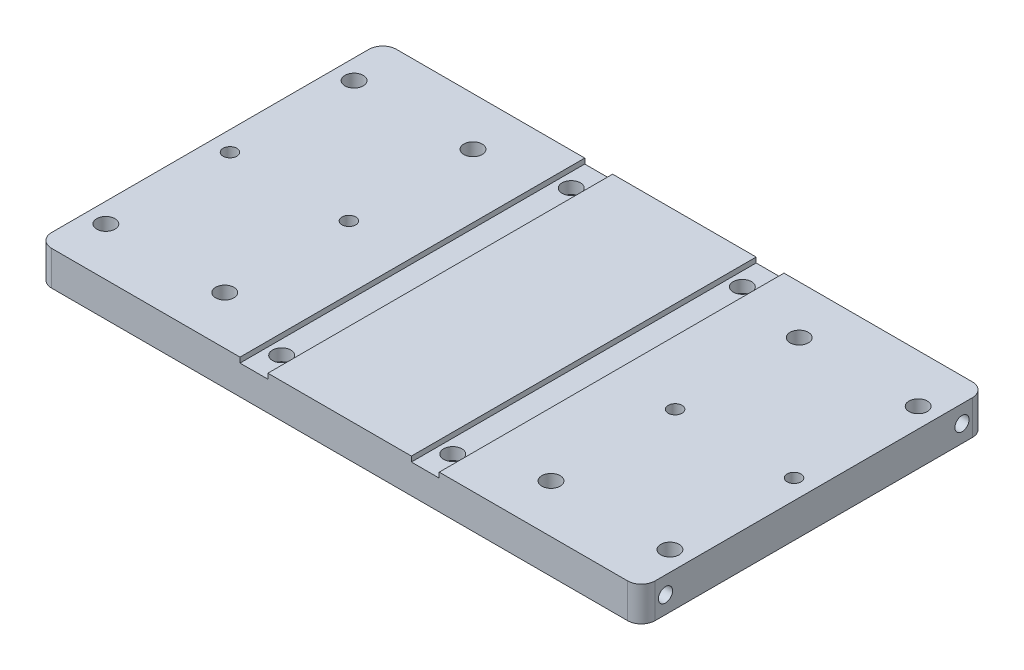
ISO-10303-21;
HEADER;
FILE_DESCRIPTION(('STEP AP214'),'2;1');
FILE_NAME('part.step','',(''),(''),'','','');
FILE_SCHEMA(('AUTOMOTIVE_DESIGN { 1 0 10303 214 1 1 1 1 }'));
ENDSEC;
DATA;
#1=APPLICATION_CONTEXT('core data for automotive mechanical design processes');
#2=APPLICATION_PROTOCOL_DEFINITION('international standard','automotive_design',2000,#1);
#3=PRODUCT_CONTEXT('',#1,'mechanical');
#4=PRODUCT('Part','Part','',(#3));
#5=PRODUCT_RELATED_PRODUCT_CATEGORY('part','',(#4));
#6=PRODUCT_DEFINITION_FORMATION('','',#4);
#7=PRODUCT_DEFINITION_CONTEXT('part definition',#1,'design');
#8=PRODUCT_DEFINITION('design','',#6,#7);
#9=PRODUCT_DEFINITION_SHAPE('','',#8);
#10=(LENGTH_UNIT() NAMED_UNIT(*) SI_UNIT(.MILLI.,.METRE.));
#11=(NAMED_UNIT(*) PLANE_ANGLE_UNIT() SI_UNIT($,.RADIAN.));
#12=(NAMED_UNIT(*) SI_UNIT($,.STERADIAN.) SOLID_ANGLE_UNIT());
#13=UNCERTAINTY_MEASURE_WITH_UNIT(LENGTH_MEASURE(1.E-05),#10,'distance_accuracy_value','');
#14=(GEOMETRIC_REPRESENTATION_CONTEXT(3) GLOBAL_UNCERTAINTY_ASSIGNED_CONTEXT((#13)) GLOBAL_UNIT_ASSIGNED_CONTEXT((#10,
#11,#12)) REPRESENTATION_CONTEXT('',''));
#15=CARTESIAN_POINT('',(0.,0.,0.));
#16=DIRECTION('',(0.,0.,1.));
#17=DIRECTION('',(1.,0.,0.));
#18=AXIS2_PLACEMENT_3D('',#15,#16,#17);
#19=CARTESIAN_POINT('',(-138.938,7.9375,-79.375));
#20=DIRECTION('',(1.,0.,0.));
#21=DIRECTION('',(0.,0.,-1.));
#22=AXIS2_PLACEMENT_3D('',#19,#20,#21);
#23=PLANE('',#22);
#24=CARTESIAN_POINT('',(-138.938,0.,-68.2625));
#25=DIRECTION('',(-1.,0.,0.));
#26=DIRECTION('',(0.,0.,1.));
#27=AXIS2_PLACEMENT_3D('',#24,#25,#26);
#28=CIRCLE('',#27,3.2639);
#29=CARTESIAN_POINT('',(-138.938,0.,-64.9986));
#30=VERTEX_POINT('',#29);
#31=EDGE_CURVE('E172',#30,#30,#28,.T.);
#32=ORIENTED_EDGE('',*,*,#31,.F.);
#33=EDGE_LOOP('',(#32));
#34=FACE_BOUND('',#33,.T.);
#35=DIRECTION('',(0.,0.,1.));
#36=VECTOR('',#35,1.);
#37=CARTESIAN_POINT('',(-138.938,-7.9375,-79.375));
#38=LINE('',#37,#36);
#39=CARTESIAN_POINT('',(-138.938,-7.9375,-73.025));
#40=VERTEX_POINT('',#39);
#41=CARTESIAN_POINT('',(-138.938,-7.9375,73.025));
#42=VERTEX_POINT('',#41);
#43=EDGE_CURVE('E428',#40,#42,#38,.T.);
#44=ORIENTED_EDGE('',*,*,#43,.T.);
#45=DIRECTION('',(0.,-1.,0.));
#46=VECTOR('',#45,1.);
#47=CARTESIAN_POINT('',(-138.938,7.9375,73.025));
#48=LINE('',#47,#46);
#49=CARTESIAN_POINT('',(-138.938,7.9375,73.025));
#50=VERTEX_POINT('',#49);
#51=EDGE_CURVE('E456',#42,#50,#48,.F.);
#52=ORIENTED_EDGE('',*,*,#51,.T.);
#53=DIRECTION('',(0.,0.,1.));
#54=VECTOR('',#53,1.);
#55=CARTESIAN_POINT('',(-138.938,7.9375,-79.375));
#56=LINE('',#55,#54);
#57=CARTESIAN_POINT('',(-138.938,7.9375,-73.025));
#58=VERTEX_POINT('',#57);
#59=EDGE_CURVE('E415',#58,#50,#56,.T.);
#60=ORIENTED_EDGE('',*,*,#59,.F.);
#61=DIRECTION('',(0.,-1.,0.));
#62=VECTOR('',#61,1.);
#63=CARTESIAN_POINT('',(-138.938,7.9375,-73.025));
#64=LINE('',#63,#62);
#65=EDGE_CURVE('E453',#58,#40,#64,.T.);
#66=ORIENTED_EDGE('',*,*,#65,.T.);
#67=EDGE_LOOP('',(#44,#52,#60,#66));
#68=FACE_BOUND('',#67,.T.);
#69=CARTESIAN_POINT('',(-138.938,0.,68.2625));
#70=DIRECTION('',(-1.,0.,0.));
#71=DIRECTION('',(0.,0.,1.));
#72=AXIS2_PLACEMENT_3D('',#69,#70,#71);
#73=CIRCLE('',#72,3.2639);
#74=CARTESIAN_POINT('',(-138.938,0.,71.5264));
#75=VERTEX_POINT('',#74);
#76=EDGE_CURVE('E173',#75,#75,#73,.T.);
#77=ORIENTED_EDGE('',*,*,#76,.F.);
#78=EDGE_LOOP('',(#77));
#79=FACE_BOUND('',#78,.T.);
#80=ADVANCED_FACE('F39',(#34,#68,#79),#23,.F.);
#81=CARTESIAN_POINT('',(0.,-7.9375,0.));
#82=DIRECTION('',(0.,1.,0.));
#83=DIRECTION('',(0.,0.,1.));
#84=AXIS2_PLACEMENT_3D('',#81,#82,#83);
#85=PLANE('',#84);
#86=CARTESIAN_POINT('',(129.870200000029,-7.9375,2.03670507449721E-11));
#87=DIRECTION('',(0.,1.,0.));
#88=DIRECTION('',(0.,0.,1.));
#89=AXIS2_PLACEMENT_3D('',#86,#87,#88);
#90=CIRCLE('',#89,3.17499999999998);
#91=CARTESIAN_POINT('',(129.870200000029,-7.9375,3.17500000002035));
#92=VERTEX_POINT('',#91);
#93=EDGE_CURVE('E186',#92,#92,#90,.T.);
#94=ORIENTED_EDGE('',*,*,#93,.T.);
#95=EDGE_LOOP('',(#94));
#96=FACE_BOUND('',#95,.T.);
#97=CARTESIAN_POINT('',(75.1078000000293,-7.9375,2.03776904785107E-11));
#98=DIRECTION('',(0.,1.,0.));
#99=DIRECTION('',(0.,0.,1.));
#100=AXIS2_PLACEMENT_3D('',#97,#98,#99);
#101=CIRCLE('',#100,3.175);
#102=CARTESIAN_POINT('',(75.1078000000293,-7.9375,3.17500000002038));
#103=VERTEX_POINT('',#102);
#104=EDGE_CURVE('E192',#103,#103,#101,.T.);
#105=ORIENTED_EDGE('',*,*,#104,.T.);
#106=EDGE_LOOP('',(#105));
#107=FACE_BOUND('',#106,.T.);
#108=CARTESIAN_POINT('',(-129.870199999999,-7.9375,1.2523582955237E-11));
#109=DIRECTION('',(0.,1.,0.));
#110=DIRECTION('',(0.,0.,1.));
#111=AXIS2_PLACEMENT_3D('',#108,#109,#110);
#112=CIRCLE('',#111,3.17499999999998);
#113=CARTESIAN_POINT('',(-129.870199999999,-7.9375,3.17500000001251));
#114=VERTEX_POINT('',#113);
#115=EDGE_CURVE('E198',#114,#114,#112,.T.);
#116=ORIENTED_EDGE('',*,*,#115,.T.);
#117=EDGE_LOOP('',(#116));
#118=FACE_BOUND('',#117,.T.);
#119=CARTESIAN_POINT('',(-75.1077999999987,-7.9375,1.21571173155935E-11));
#120=DIRECTION('',(0.,1.,0.));
#121=DIRECTION('',(0.,0.,1.));
#122=AXIS2_PLACEMENT_3D('',#119,#120,#121);
#123=CIRCLE('',#122,3.175);
#124=CARTESIAN_POINT('',(-75.1077999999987,-7.9375,3.17500000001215));
#125=VERTEX_POINT('',#124);
#126=EDGE_CURVE('E204',#125,#125,#123,.T.);
#127=ORIENTED_EDGE('',*,*,#126,.T.);
#128=EDGE_LOOP('',(#127));
#129=FACE_BOUND('',#128,.T.);
#130=CARTESIAN_POINT('',(-75.1077999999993,-7.9375,-57.1499999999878));
#131=DIRECTION('',(0.,-1.,0.));
#132=DIRECTION('',(0.,0.,-1.));
#133=AXIS2_PLACEMENT_3D('',#130,#131,#132);
#134=CIRCLE('',#133,6.74751);
#135=CARTESIAN_POINT('',(-75.1077999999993,-7.9375,-63.8975099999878));
#136=VERTEX_POINT('',#135);
#137=EDGE_CURVE('E207',#136,#136,#134,.T.);
#138=ORIENTED_EDGE('',*,*,#137,.F.);
#139=EDGE_LOOP('',(#138));
#140=FACE_BOUND('',#139,.T.);
#141=CARTESIAN_POINT('',(129.870200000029,-7.9375,57.1500000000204));
#142=DIRECTION('',(0.,-1.,0.));
#143=DIRECTION('',(0.,0.,-1.));
#144=AXIS2_PLACEMENT_3D('',#141,#142,#143);
#145=CIRCLE('',#144,6.74751000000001);
#146=CARTESIAN_POINT('',(129.870200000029,-7.9375,50.4024900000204));
#147=VERTEX_POINT('',#146);
#148=EDGE_CURVE('E255',#147,#147,#145,.T.);
#149=ORIENTED_EDGE('',*,*,#148,.F.);
#150=EDGE_LOOP('',(#149));
#151=FACE_BOUND('',#150,.T.);
#152=CARTESIAN_POINT('',(129.870200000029,-7.9375,-57.1499999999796));
#153=DIRECTION('',(0.,-1.,0.));
#154=DIRECTION('',(0.,0.,-1.));
#155=AXIS2_PLACEMENT_3D('',#152,#153,#154);
#156=CIRCLE('',#155,6.74751000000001);
#157=CARTESIAN_POINT('',(129.870200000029,-7.9375,-63.8975099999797));
#158=VERTEX_POINT('',#157);
#159=EDGE_CURVE('E267',#158,#158,#156,.T.);
#160=ORIENTED_EDGE('',*,*,#159,.F.);
#161=EDGE_LOOP('',(#160));
#162=FACE_BOUND('',#161,.T.);
#163=CARTESIAN_POINT('',(75.1078000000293,-7.9375,57.1500000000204));
#164=DIRECTION('',(0.,-1.,0.));
#165=DIRECTION('',(0.,0.,-1.));
#166=AXIS2_PLACEMENT_3D('',#163,#164,#165);
#167=CIRCLE('',#166,6.74751);
#168=CARTESIAN_POINT('',(75.1078000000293,-7.9375,50.4024900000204));
#169=VERTEX_POINT('',#168);
#170=EDGE_CURVE('E279',#169,#169,#167,.T.);
#171=ORIENTED_EDGE('',*,*,#170,.F.);
#172=EDGE_LOOP('',(#171));
#173=FACE_BOUND('',#172,.T.);
#174=CARTESIAN_POINT('',(75.1078000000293,-7.9375,-57.1499999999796));
#175=DIRECTION('',(0.,-1.,0.));
#176=DIRECTION('',(0.,0.,-1.));
#177=AXIS2_PLACEMENT_3D('',#174,#175,#176);
#178=CIRCLE('',#177,6.74751);
#179=CARTESIAN_POINT('',(75.1078000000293,-7.9375,-63.8975099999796));
#180=VERTEX_POINT('',#179);
#181=EDGE_CURVE('E291',#180,#180,#178,.T.);
#182=ORIENTED_EDGE('',*,*,#181,.F.);
#183=EDGE_LOOP('',(#182));
#184=FACE_BOUND('',#183,.T.);
#185=CARTESIAN_POINT('',(-39.3953999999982,-7.9375,66.6750000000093));
#186=DIRECTION('',(0.,-1.,0.));
#187=DIRECTION('',(0.,0.,-1.));
#188=AXIS2_PLACEMENT_3D('',#185,#186,#187);
#189=CIRCLE('',#188,6.74751);
#190=CARTESIAN_POINT('',(-39.3953999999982,-7.9375,59.9274900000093));
#191=VERTEX_POINT('',#190);
#192=EDGE_CURVE('E325',#191,#191,#189,.T.);
#193=ORIENTED_EDGE('',*,*,#192,.F.);
#194=EDGE_LOOP('',(#193));
#195=FACE_BOUND('',#194,.T.);
#196=CARTESIAN_POINT('',(39.3953999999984,-7.9375,66.6750000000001));
#197=DIRECTION('',(0.,-1.,0.));
#198=DIRECTION('',(0.,0.,-1.));
#199=AXIS2_PLACEMENT_3D('',#196,#197,#198);
#200=CIRCLE('',#199,6.74751);
#201=CARTESIAN_POINT('',(39.3953999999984,-7.9375,59.9274900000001));
#202=VERTEX_POINT('',#201);
#203=EDGE_CURVE('E335',#202,#202,#200,.T.);
#204=ORIENTED_EDGE('',*,*,#203,.F.);
#205=EDGE_LOOP('',(#204));
#206=FACE_BOUND('',#205,.T.);
#207=CARTESIAN_POINT('',(39.3953999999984,-7.9375,-66.675));
#208=DIRECTION('',(0.,-1.,0.));
#209=DIRECTION('',(0.,0.,-1.));
#210=AXIS2_PLACEMENT_3D('',#207,#208,#209);
#211=CIRCLE('',#210,6.74751);
#212=CARTESIAN_POINT('',(39.3953999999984,-7.9375,-73.42251));
#213=VERTEX_POINT('',#212);
#214=EDGE_CURVE('E345',#213,#213,#211,.T.);
#215=ORIENTED_EDGE('',*,*,#214,.F.);
#216=EDGE_LOOP('',(#215));
#217=FACE_BOUND('',#216,.T.);
#218=DIRECTION('',(1.,0.,0.));
#219=VECTOR('',#218,1.);
#220=CARTESIAN_POINT('',(-138.938,-7.9375,79.375));
#221=LINE('',#220,#219);
#222=CARTESIAN_POINT('',(-132.588,-7.9375,79.375));
#223=VERTEX_POINT('',#222);
#224=CARTESIAN_POINT('',(132.588,-7.9375,79.375));
#225=VERTEX_POINT('',#224);
#226=EDGE_CURVE('E412',#223,#225,#221,.T.);
#227=ORIENTED_EDGE('',*,*,#226,.F.);
#228=CARTESIAN_POINT('',(-132.588,-7.9375,73.025));
#229=DIRECTION('',(0.,1.,0.));
#230=DIRECTION('',(0.,0.,1.));
#231=AXIS2_PLACEMENT_3D('',#228,#229,#230);
#232=CIRCLE('',#231,6.35);
#233=EDGE_CURVE('E451',#223,#42,#232,.F.);
#234=ORIENTED_EDGE('',*,*,#233,.T.);
#235=ORIENTED_EDGE('',*,*,#43,.F.);
#236=CARTESIAN_POINT('',(-132.588,-7.9375,-73.025));
#237=DIRECTION('',(0.,1.,0.));
#238=DIRECTION('',(0.,0.,1.));
#239=AXIS2_PLACEMENT_3D('',#236,#237,#238);
#240=CIRCLE('',#239,6.35);
#241=CARTESIAN_POINT('',(-132.588,-7.9375,-79.375));
#242=VERTEX_POINT('',#241);
#243=EDGE_CURVE('E449',#40,#242,#240,.F.);
#244=ORIENTED_EDGE('',*,*,#243,.T.);
#245=DIRECTION('',(-1.,0.,0.));
#246=VECTOR('',#245,1.);
#247=CARTESIAN_POINT('',(-138.938,-7.9375,-79.375));
#248=LINE('',#247,#246);
#249=CARTESIAN_POINT('',(132.588,-7.9375,-79.375));
#250=VERTEX_POINT('',#249);
#251=EDGE_CURVE('E425',#250,#242,#248,.T.);
#252=ORIENTED_EDGE('',*,*,#251,.F.);
#253=CARTESIAN_POINT('',(132.588,-7.9375,-73.025));
#254=DIRECTION('',(0.,1.,0.));
#255=DIRECTION('',(0.,0.,1.));
#256=AXIS2_PLACEMENT_3D('',#253,#254,#255);
#257=CIRCLE('',#256,6.35);
#258=CARTESIAN_POINT('',(138.938,-7.9375,-73.025));
#259=VERTEX_POINT('',#258);
#260=EDGE_CURVE('E447',#250,#259,#257,.F.);
#261=ORIENTED_EDGE('',*,*,#260,.T.);
#262=DIRECTION('',(0.,0.,-1.));
#263=VECTOR('',#262,1.);
#264=CARTESIAN_POINT('',(138.938,-7.9375,-79.375));
#265=LINE('',#264,#263);
#266=CARTESIAN_POINT('',(138.938,-7.9375,73.025));
#267=VERTEX_POINT('',#266);
#268=EDGE_CURVE('E376',#267,#259,#265,.T.);
#269=ORIENTED_EDGE('',*,*,#268,.F.);
#270=CARTESIAN_POINT('',(132.588,-7.9375,73.025));
#271=DIRECTION('',(0.,1.,0.));
#272=DIRECTION('',(0.,0.,1.));
#273=AXIS2_PLACEMENT_3D('',#270,#271,#272);
#274=CIRCLE('',#273,6.35);
#275=EDGE_CURVE('E445',#267,#225,#274,.F.);
#276=ORIENTED_EDGE('',*,*,#275,.T.);
#277=EDGE_LOOP('',(#227,#234,#235,#244,#252,#261,#269,#276));
#278=FACE_BOUND('',#277,.T.);
#279=CARTESIAN_POINT('',(-39.3953999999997,-7.9375,-66.6749999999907));
#280=DIRECTION('',(0.,-1.,0.));
#281=DIRECTION('',(0.,0.,-1.));
#282=AXIS2_PLACEMENT_3D('',#279,#280,#281);
#283=CIRCLE('',#282,6.74751);
#284=CARTESIAN_POINT('',(-39.3953999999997,-7.9375,-73.4225099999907));
#285=VERTEX_POINT('',#284);
#286=EDGE_CURVE('E315',#285,#285,#283,.T.);
#287=ORIENTED_EDGE('',*,*,#286,.F.);
#288=EDGE_LOOP('',(#287));
#289=FACE_BOUND('',#288,.T.);
#290=CARTESIAN_POINT('',(-129.870199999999,-7.9375,-57.1499999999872));
#291=DIRECTION('',(0.,-1.,0.));
#292=DIRECTION('',(0.,0.,-1.));
#293=AXIS2_PLACEMENT_3D('',#290,#291,#292);
#294=CIRCLE('',#293,6.74751);
#295=CARTESIAN_POINT('',(-129.870199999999,-7.9375,-63.8975099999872));
#296=VERTEX_POINT('',#295);
#297=EDGE_CURVE('E243',#296,#296,#294,.T.);
#298=ORIENTED_EDGE('',*,*,#297,.F.);
#299=EDGE_LOOP('',(#298));
#300=FACE_BOUND('',#299,.T.);
#301=CARTESIAN_POINT('',(-129.870199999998,-7.9375,57.1500000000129));
#302=DIRECTION('',(0.,-1.,0.));
#303=DIRECTION('',(0.,0.,-1.));
#304=AXIS2_PLACEMENT_3D('',#301,#302,#303);
#305=CIRCLE('',#304,6.74751);
#306=CARTESIAN_POINT('',(-129.870199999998,-7.9375,50.4024900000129));
#307=VERTEX_POINT('',#306);
#308=EDGE_CURVE('E231',#307,#307,#305,.T.);
#309=ORIENTED_EDGE('',*,*,#308,.F.);
#310=EDGE_LOOP('',(#309));
#311=FACE_BOUND('',#310,.T.);
#312=CARTESIAN_POINT('',(-75.107799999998,-7.9375,57.1500000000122));
#313=DIRECTION('',(0.,-1.,0.));
#314=DIRECTION('',(0.,0.,-1.));
#315=AXIS2_PLACEMENT_3D('',#312,#313,#314);
#316=CIRCLE('',#315,6.74751);
#317=CARTESIAN_POINT('',(-75.107799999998,-7.9375,50.4024900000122));
#318=VERTEX_POINT('',#317);
#319=EDGE_CURVE('E219',#318,#318,#316,.T.);
#320=ORIENTED_EDGE('',*,*,#319,.F.);
#321=EDGE_LOOP('',(#320));
#322=FACE_BOUND('',#321,.T.);
#323=ADVANCED_FACE('F476',(#96,#107,#118,#129,#140,#151,#162,#173,#184,#195,#206,#217,#278,#289,
#300,#311,#322),#85,.F.);
#324=CARTESIAN_POINT('',(0.,7.9375,0.));
#325=DIRECTION('',(0.,1.,0.));
#326=DIRECTION('',(0.,0.,1.));
#327=AXIS2_PLACEMENT_3D('',#324,#325,#326);
#328=PLANE('',#327);
#329=DIRECTION('',(0.,0.,-1.));
#330=VECTOR('',#329,1.);
#331=CARTESIAN_POINT('',(33.0453999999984,7.9375,79.375));
#332=LINE('',#331,#330);
#333=CARTESIAN_POINT('',(33.0453999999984,7.9375,79.375));
#334=VERTEX_POINT('',#333);
#335=CARTESIAN_POINT('',(33.0453999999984,7.9375,-79.375));
#336=VERTEX_POINT('',#335);
#337=EDGE_CURVE('E365',#334,#336,#332,.T.);
#338=ORIENTED_EDGE('',*,*,#337,.T.);
#339=DIRECTION('',(-1.,0.,0.));
#340=VECTOR('',#339,1.);
#341=CARTESIAN_POINT('',(-138.938,7.9375,-79.375));
#342=LINE('',#341,#340);
#343=CARTESIAN_POINT('',(-33.0453999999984,7.93750000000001,-79.375));
#344=VERTEX_POINT('',#343);
#345=EDGE_CURVE('E416',#336,#344,#342,.T.);
#346=ORIENTED_EDGE('',*,*,#345,.T.);
#347=DIRECTION('',(0.,0.,-1.));
#348=VECTOR('',#347,1.);
#349=CARTESIAN_POINT('',(-33.0453999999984,7.93750000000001,79.375));
#350=LINE('',#349,#348);
#351=CARTESIAN_POINT('',(-33.0453999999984,7.93750000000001,79.375));
#352=VERTEX_POINT('',#351);
#353=EDGE_CURVE('E403',#352,#344,#350,.T.);
#354=ORIENTED_EDGE('',*,*,#353,.F.);
#355=DIRECTION('',(1.,0.,0.));
#356=VECTOR('',#355,1.);
#357=CARTESIAN_POINT('',(-138.938,7.9375,79.375));
#358=LINE('',#357,#356);
#359=EDGE_CURVE('E423',#352,#334,#358,.T.);
#360=ORIENTED_EDGE('',*,*,#359,.T.);
#361=EDGE_LOOP('',(#338,#346,#354,#360));
#362=FACE_BOUND('',#361,.T.);
#363=ADVANCED_FACE('F503',(#362),#328,.T.);
#364=CARTESIAN_POINT('',(129.870200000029,7.9375,2.03670507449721E-11));
#365=DIRECTION('',(0.,1.,0.));
#366=DIRECTION('',(0.,0.,1.));
#367=AXIS2_PLACEMENT_3D('',#364,#365,#366);
#368=CIRCLE('',#367,3.17500000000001);
#369=CARTESIAN_POINT('',(129.870200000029,7.9375,3.17500000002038));
#370=VERTEX_POINT('',#369);
#371=EDGE_CURVE('E183',#370,#370,#368,.T.);
#372=ORIENTED_EDGE('',*,*,#371,.F.);
#373=EDGE_LOOP('',(#372));
#374=FACE_BOUND('',#373,.T.);
#375=CARTESIAN_POINT('',(75.1078000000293,7.9375,2.03776904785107E-11));
#376=DIRECTION('',(0.,1.,0.));
#377=DIRECTION('',(0.,0.,1.));
#378=AXIS2_PLACEMENT_3D('',#375,#376,#377);
#379=CIRCLE('',#378,3.175);
#380=CARTESIAN_POINT('',(75.1078000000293,7.9375,3.17500000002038));
#381=VERTEX_POINT('',#380);
#382=EDGE_CURVE('E189',#381,#381,#379,.T.);
#383=ORIENTED_EDGE('',*,*,#382,.F.);
#384=EDGE_LOOP('',(#383));
#385=FACE_BOUND('',#384,.T.);
#386=CARTESIAN_POINT('',(129.870200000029,7.93750000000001,57.1500000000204));
#387=DIRECTION('',(0.,-1.,0.));
#388=DIRECTION('',(0.,0.,-1.));
#389=AXIS2_PLACEMENT_3D('',#386,#387,#388);
#390=CIRCLE('',#389,4.21640000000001);
#391=CARTESIAN_POINT('',(129.870200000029,7.93750000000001,52.9336000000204));
#392=VERTEX_POINT('',#391);
#393=EDGE_CURVE('E264',#392,#392,#390,.T.);
#394=ORIENTED_EDGE('',*,*,#393,.T.);
#395=EDGE_LOOP('',(#394));
#396=FACE_BOUND('',#395,.T.);
#397=CARTESIAN_POINT('',(129.870200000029,7.93750000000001,-57.1499999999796));
#398=DIRECTION('',(0.,-1.,0.));
#399=DIRECTION('',(0.,0.,-1.));
#400=AXIS2_PLACEMENT_3D('',#397,#398,#399);
#401=CIRCLE('',#400,4.21640000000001);
#402=CARTESIAN_POINT('',(129.870200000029,7.93750000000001,-61.3663999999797));
#403=VERTEX_POINT('',#402);
#404=EDGE_CURVE('E276',#403,#403,#401,.T.);
#405=ORIENTED_EDGE('',*,*,#404,.T.);
#406=EDGE_LOOP('',(#405));
#407=FACE_BOUND('',#406,.T.);
#408=CARTESIAN_POINT('',(75.1078000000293,7.93750000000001,57.1500000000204));
#409=DIRECTION('',(0.,-1.,0.));
#410=DIRECTION('',(0.,0.,-1.));
#411=AXIS2_PLACEMENT_3D('',#408,#409,#410);
#412=CIRCLE('',#411,4.21639999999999);
#413=CARTESIAN_POINT('',(75.1078000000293,7.93750000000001,52.9336000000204));
#414=VERTEX_POINT('',#413);
#415=EDGE_CURVE('E288',#414,#414,#412,.T.);
#416=ORIENTED_EDGE('',*,*,#415,.T.);
#417=EDGE_LOOP('',(#416));
#418=FACE_BOUND('',#417,.T.);
#419=CARTESIAN_POINT('',(75.1078000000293,7.93750000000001,-57.1499999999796));
#420=DIRECTION('',(0.,-1.,0.));
#421=DIRECTION('',(0.,0.,-1.));
#422=AXIS2_PLACEMENT_3D('',#419,#420,#421);
#423=CIRCLE('',#422,4.21639999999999);
#424=CARTESIAN_POINT('',(75.1078000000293,7.93750000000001,-61.3663999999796));
#425=VERTEX_POINT('',#424);
#426=EDGE_CURVE('E300',#425,#425,#423,.T.);
#427=ORIENTED_EDGE('',*,*,#426,.T.);
#428=EDGE_LOOP('',(#427));
#429=FACE_BOUND('',#428,.T.);
#430=DIRECTION('',(0.,0.,-1.));
#431=VECTOR('',#430,1.);
#432=CARTESIAN_POINT('',(138.938,7.9375,-79.375));
#433=LINE('',#432,#431);
#434=CARTESIAN_POINT('',(138.938,7.9375,73.025));
#435=VERTEX_POINT('',#434);
#436=CARTESIAN_POINT('',(138.938,7.9375,-73.025));
#437=VERTEX_POINT('',#436);
#438=EDGE_CURVE('E409',#435,#437,#433,.T.);
#439=ORIENTED_EDGE('',*,*,#438,.T.);
#440=CARTESIAN_POINT('',(132.588,7.9375,-73.025));
#441=DIRECTION('',(0.,1.,0.));
#442=DIRECTION('',(0.,0.,1.));
#443=AXIS2_PLACEMENT_3D('',#440,#441,#442);
#444=CIRCLE('',#443,6.35);
#445=CARTESIAN_POINT('',(132.588,7.9375,-79.375));
#446=VERTEX_POINT('',#445);
#447=EDGE_CURVE('E11',#437,#446,#444,.T.);
#448=ORIENTED_EDGE('',*,*,#447,.T.);
#449=CARTESIAN_POINT('',(45.8723999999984,7.9375,-79.375));
#450=VERTEX_POINT('',#449);
#451=EDGE_CURVE('E413',#446,#450,#342,.T.);
#452=ORIENTED_EDGE('',*,*,#451,.T.);
#453=DIRECTION('',(0.,0.,-1.));
#454=VECTOR('',#453,1.);
#455=CARTESIAN_POINT('',(45.8723999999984,7.9375,79.375));
#456=LINE('',#455,#454);
#457=CARTESIAN_POINT('',(45.8723999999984,7.9375,79.375));
#458=VERTEX_POINT('',#457);
#459=EDGE_CURVE('E379',#458,#450,#456,.T.);
#460=ORIENTED_EDGE('',*,*,#459,.F.);
#461=CARTESIAN_POINT('',(132.588,7.9375,79.375));
#462=VERTEX_POINT('',#461);
#463=EDGE_CURVE('E419',#458,#462,#358,.T.);
#464=ORIENTED_EDGE('',*,*,#463,.T.);
#465=CARTESIAN_POINT('',(132.588,7.9375,73.025));
#466=DIRECTION('',(0.,1.,0.));
#467=DIRECTION('',(0.,0.,1.));
#468=AXIS2_PLACEMENT_3D('',#465,#466,#467);
#469=CIRCLE('',#468,6.35);
#470=EDGE_CURVE('E47',#462,#435,#469,.T.);
#471=ORIENTED_EDGE('',*,*,#470,.T.);
#472=EDGE_LOOP('',(#439,#448,#452,#460,#464,#471));
#473=FACE_BOUND('',#472,.T.);
#474=ADVANCED_FACE('F490',(#374,#385,#396,#407,#418,#429,#473),#328,.T.);
#475=CARTESIAN_POINT('',(138.938,7.9375,-79.375));
#476=DIRECTION('',(-1.,0.,0.));
#477=DIRECTION('',(0.,0.,1.));
#478=AXIS2_PLACEMENT_3D('',#475,#476,#477);
#479=PLANE('',#478);
#480=CARTESIAN_POINT('',(138.938,0.,68.2625));
#481=DIRECTION('',(1.,0.,0.));
#482=DIRECTION('',(0.,0.,-1.));
#483=AXIS2_PLACEMENT_3D('',#480,#481,#482);
#484=CIRCLE('',#483,3.2639);
#485=CARTESIAN_POINT('',(138.938,0.,64.9986));
#486=VERTEX_POINT('',#485);
#487=EDGE_CURVE('E303',#486,#486,#484,.T.);
#488=ORIENTED_EDGE('',*,*,#487,.F.);
#489=EDGE_LOOP('',(#488));
#490=FACE_BOUND('',#489,.T.);
#491=CARTESIAN_POINT('',(138.938,0.,-68.2625));
#492=DIRECTION('',(1.,0.,0.));
#493=DIRECTION('',(0.,0.,-1.));
#494=AXIS2_PLACEMENT_3D('',#491,#492,#493);
#495=CIRCLE('',#494,3.2639);
#496=CARTESIAN_POINT('',(138.938,0.,-71.5264));
#497=VERTEX_POINT('',#496);
#498=EDGE_CURVE('E309',#497,#497,#495,.T.);
#499=ORIENTED_EDGE('',*,*,#498,.F.);
#500=EDGE_LOOP('',(#499));
#501=FACE_BOUND('',#500,.T.);
#502=ORIENTED_EDGE('',*,*,#268,.T.);
#503=DIRECTION('',(0.,-1.,0.));
#504=VECTOR('',#503,1.);
#505=CARTESIAN_POINT('',(138.938,7.9375,-73.025));
#506=LINE('',#505,#504);
#507=EDGE_CURVE('E54',#259,#437,#506,.F.);
#508=ORIENTED_EDGE('',*,*,#507,.T.);
#509=ORIENTED_EDGE('',*,*,#438,.F.);
#510=DIRECTION('',(0.,-1.,0.));
#511=VECTOR('',#510,1.);
#512=CARTESIAN_POINT('',(138.938,7.9375,73.025));
#513=LINE('',#512,#511);
#514=EDGE_CURVE('E467',#435,#267,#513,.T.);
#515=ORIENTED_EDGE('',*,*,#514,.T.);
#516=EDGE_LOOP('',(#502,#508,#509,#515));
#517=FACE_BOUND('',#516,.T.);
#518=ADVANCED_FACE('F472',(#490,#501,#517),#479,.F.);
#519=CARTESIAN_POINT('',(-138.938,7.9375,-79.375));
#520=DIRECTION('',(0.,0.,1.));
#521=DIRECTION('',(1.,0.,0.));
#522=AXIS2_PLACEMENT_3D('',#519,#520,#521);
#523=PLANE('',#522);
#524=ORIENTED_EDGE('',*,*,#251,.T.);
#525=DIRECTION('',(0.,-1.,0.));
#526=VECTOR('',#525,1.);
#527=CARTESIAN_POINT('',(-132.588,7.9375,-79.375));
#528=LINE('',#527,#526);
#529=CARTESIAN_POINT('',(-132.588,7.9375,-79.375));
#530=VERTEX_POINT('',#529);
#531=EDGE_CURVE('E465',#242,#530,#528,.F.);
#532=ORIENTED_EDGE('',*,*,#531,.T.);
#533=CARTESIAN_POINT('',(-45.8723999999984,7.9375,-79.375));
#534=VERTEX_POINT('',#533);
#535=EDGE_CURVE('E411',#534,#530,#342,.T.);
#536=ORIENTED_EDGE('',*,*,#535,.F.);
#537=DIRECTION('',(0.,1.,0.));
#538=VECTOR('',#537,1.);
#539=CARTESIAN_POINT('',(-45.8723999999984,5.55149257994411,-79.375));
#540=LINE('',#539,#538);
#541=CARTESIAN_POINT('',(-45.8723999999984,5.55149257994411,-79.375));
#542=VERTEX_POINT('',#541);
#543=EDGE_CURVE('E398',#542,#534,#540,.T.);
#544=ORIENTED_EDGE('',*,*,#543,.F.);
#545=DIRECTION('',(-1.,0.,0.));
#546=VECTOR('',#545,1.);
#547=CARTESIAN_POINT('',(-33.0453999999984,5.55149257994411,-79.375));
#548=LINE('',#547,#546);
#549=CARTESIAN_POINT('',(-33.0453999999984,5.55149257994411,-79.375));
#550=VERTEX_POINT('',#549);
#551=EDGE_CURVE('E395',#550,#542,#548,.T.);
#552=ORIENTED_EDGE('',*,*,#551,.F.);
#553=DIRECTION('',(0.,-1.,0.));
#554=VECTOR('',#553,1.);
#555=CARTESIAN_POINT('',(-33.0453999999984,5.55149257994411,-79.375));
#556=LINE('',#555,#554);
#557=EDGE_CURVE('E388',#344,#550,#556,.T.);
#558=ORIENTED_EDGE('',*,*,#557,.F.);
#559=ORIENTED_EDGE('',*,*,#345,.F.);
#560=DIRECTION('',(0.,1.,0.));
#561=VECTOR('',#560,1.);
#562=CARTESIAN_POINT('',(33.0453999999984,5.5514925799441,-79.375));
#563=LINE('',#562,#561);
#564=CARTESIAN_POINT('',(33.0453999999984,5.5514925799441,-79.375));
#565=VERTEX_POINT('',#564);
#566=EDGE_CURVE('E366',#565,#336,#563,.T.);
#567=ORIENTED_EDGE('',*,*,#566,.F.);
#568=DIRECTION('',(-1.,0.,0.));
#569=VECTOR('',#568,1.);
#570=CARTESIAN_POINT('',(33.0453999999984,5.5514925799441,-79.375));
#571=LINE('',#570,#569);
#572=CARTESIAN_POINT('',(45.8723999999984,5.5514925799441,-79.375));
#573=VERTEX_POINT('',#572);
#574=EDGE_CURVE('E359',#573,#565,#571,.T.);
#575=ORIENTED_EDGE('',*,*,#574,.F.);
#576=DIRECTION('',(0.,-1.,0.));
#577=VECTOR('',#576,1.);
#578=CARTESIAN_POINT('',(45.8723999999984,5.5514925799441,-79.375));
#579=LINE('',#578,#577);
#580=EDGE_CURVE('E368',#450,#573,#579,.T.);
#581=ORIENTED_EDGE('',*,*,#580,.F.);
#582=ORIENTED_EDGE('',*,*,#451,.F.);
#583=DIRECTION('',(0.,-1.,0.));
#584=VECTOR('',#583,1.);
#585=CARTESIAN_POINT('',(132.588,7.9375,-79.375));
#586=LINE('',#585,#584);
#587=EDGE_CURVE('E462',#446,#250,#586,.T.);
#588=ORIENTED_EDGE('',*,*,#587,.T.);
#589=EDGE_LOOP('',(#524,#532,#536,#544,#552,#558,#559,#567,#575,#581,#582,#588));
#590=FACE_BOUND('',#589,.T.);
#591=ADVANCED_FACE('F485',(#590),#523,.F.);
#592=CARTESIAN_POINT('',(-138.938,7.9375,79.375));
#593=DIRECTION('',(0.,0.,-1.));
#594=DIRECTION('',(-1.,0.,0.));
#595=AXIS2_PLACEMENT_3D('',#592,#593,#594);
#596=PLANE('',#595);
#597=CARTESIAN_POINT('',(-132.588,7.9375,79.375));
#598=VERTEX_POINT('',#597);
#599=CARTESIAN_POINT('',(-45.8723999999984,7.93750000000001,79.375));
#600=VERTEX_POINT('',#599);
#601=EDGE_CURVE('E420',#598,#600,#358,.T.);
#602=ORIENTED_EDGE('',*,*,#601,.F.);
#603=DIRECTION('',(0.,-1.,0.));
#604=VECTOR('',#603,1.);
#605=CARTESIAN_POINT('',(-132.588,7.9375,79.375));
#606=LINE('',#605,#604);
#607=EDGE_CURVE('E442',#598,#223,#606,.T.);
#608=ORIENTED_EDGE('',*,*,#607,.T.);
#609=ORIENTED_EDGE('',*,*,#226,.T.);
#610=DIRECTION('',(0.,-1.,0.));
#611=VECTOR('',#610,1.);
#612=CARTESIAN_POINT('',(132.588,7.9375,79.375));
#613=LINE('',#612,#611);
#614=EDGE_CURVE('E422',#225,#462,#613,.F.);
#615=ORIENTED_EDGE('',*,*,#614,.T.);
#616=ORIENTED_EDGE('',*,*,#463,.F.);
#617=DIRECTION('',(0.,-1.,0.));
#618=VECTOR('',#617,1.);
#619=CARTESIAN_POINT('',(45.8723999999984,5.5514925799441,79.375));
#620=LINE('',#619,#618);
#621=CARTESIAN_POINT('',(45.8723999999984,5.5514925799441,79.375));
#622=VERTEX_POINT('',#621);
#623=EDGE_CURVE('E358',#458,#622,#620,.T.);
#624=ORIENTED_EDGE('',*,*,#623,.T.);
#625=DIRECTION('',(-1.,0.,0.));
#626=VECTOR('',#625,1.);
#627=CARTESIAN_POINT('',(33.0453999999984,5.5514925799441,79.375));
#628=LINE('',#627,#626);
#629=CARTESIAN_POINT('',(33.0453999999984,5.5514925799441,79.375));
#630=VERTEX_POINT('',#629);
#631=EDGE_CURVE('E362',#622,#630,#628,.T.);
#632=ORIENTED_EDGE('',*,*,#631,.T.);
#633=DIRECTION('',(0.,1.,0.));
#634=VECTOR('',#633,1.);
#635=CARTESIAN_POINT('',(33.0453999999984,5.5514925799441,79.375));
#636=LINE('',#635,#634);
#637=EDGE_CURVE('E355',#630,#334,#636,.T.);
#638=ORIENTED_EDGE('',*,*,#637,.T.);
#639=ORIENTED_EDGE('',*,*,#359,.F.);
#640=DIRECTION('',(0.,-1.,0.));
#641=VECTOR('',#640,1.);
#642=CARTESIAN_POINT('',(-33.0453999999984,5.55149257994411,79.375));
#643=LINE('',#642,#641);
#644=CARTESIAN_POINT('',(-33.0453999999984,5.55149257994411,79.375));
#645=VERTEX_POINT('',#644);
#646=EDGE_CURVE('E391',#352,#645,#643,.T.);
#647=ORIENTED_EDGE('',*,*,#646,.T.);
#648=DIRECTION('',(-1.,0.,0.));
#649=VECTOR('',#648,1.);
#650=CARTESIAN_POINT('',(-33.0453999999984,5.55149257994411,79.375));
#651=LINE('',#650,#649);
#652=CARTESIAN_POINT('',(-45.8723999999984,5.55149257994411,79.375));
#653=VERTEX_POINT('',#652);
#654=EDGE_CURVE('E384',#645,#653,#651,.T.);
#655=ORIENTED_EDGE('',*,*,#654,.T.);
#656=DIRECTION('',(0.,1.,0.));
#657=VECTOR('',#656,1.);
#658=CARTESIAN_POINT('',(-45.8723999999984,5.55149257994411,79.375));
#659=LINE('',#658,#657);
#660=EDGE_CURVE('E387',#653,#600,#659,.T.);
#661=ORIENTED_EDGE('',*,*,#660,.T.);
#662=EDGE_LOOP('',(#602,#608,#609,#615,#616,#624,#632,#638,#639,#647,#655,#661));
#663=FACE_BOUND('',#662,.T.);
#664=ADVANCED_FACE('F497',(#663),#596,.F.);
#665=CARTESIAN_POINT('',(-129.870199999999,7.9375,1.2523582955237E-11));
#666=DIRECTION('',(0.,1.,0.));
#667=DIRECTION('',(0.,0.,1.));
#668=AXIS2_PLACEMENT_3D('',#665,#666,#667);
#669=CIRCLE('',#668,3.17500000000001);
#670=CARTESIAN_POINT('',(-129.870199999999,7.9375,3.17500000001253));
#671=VERTEX_POINT('',#670);
#672=EDGE_CURVE('E195',#671,#671,#669,.T.);
#673=ORIENTED_EDGE('',*,*,#672,.F.);
#674=EDGE_LOOP('',(#673));
#675=FACE_BOUND('',#674,.T.);
#676=CARTESIAN_POINT('',(-75.1077999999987,7.9375,1.21571173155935E-11));
#677=DIRECTION('',(0.,1.,0.));
#678=DIRECTION('',(0.,0.,1.));
#679=AXIS2_PLACEMENT_3D('',#676,#677,#678);
#680=CIRCLE('',#679,3.175);
#681=CARTESIAN_POINT('',(-75.1077999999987,7.9375,3.17500000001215));
#682=VERTEX_POINT('',#681);
#683=EDGE_CURVE('E201',#682,#682,#680,.T.);
#684=ORIENTED_EDGE('',*,*,#683,.F.);
#685=EDGE_LOOP('',(#684));
#686=FACE_BOUND('',#685,.T.);
#687=CARTESIAN_POINT('',(-75.1077999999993,7.93750000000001,-57.1499999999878));
#688=DIRECTION('',(0.,-1.,0.));
#689=DIRECTION('',(0.,0.,-1.));
#690=AXIS2_PLACEMENT_3D('',#687,#688,#689);
#691=CIRCLE('',#690,4.21639999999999);
#692=CARTESIAN_POINT('',(-75.1077999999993,7.93750000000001,-61.3663999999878));
#693=VERTEX_POINT('',#692);
#694=EDGE_CURVE('E216',#693,#693,#691,.T.);
#695=ORIENTED_EDGE('',*,*,#694,.T.);
#696=EDGE_LOOP('',(#695));
#697=FACE_BOUND('',#696,.T.);
#698=CARTESIAN_POINT('',(-75.107799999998,7.93750000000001,57.1500000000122));
#699=DIRECTION('',(0.,-1.,0.));
#700=DIRECTION('',(0.,0.,-1.));
#701=AXIS2_PLACEMENT_3D('',#698,#699,#700);
#702=CIRCLE('',#701,4.21639999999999);
#703=CARTESIAN_POINT('',(-75.107799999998,7.93750000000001,52.9336000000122));
#704=VERTEX_POINT('',#703);
#705=EDGE_CURVE('E228',#704,#704,#702,.T.);
#706=ORIENTED_EDGE('',*,*,#705,.T.);
#707=EDGE_LOOP('',(#706));
#708=FACE_BOUND('',#707,.T.);
#709=CARTESIAN_POINT('',(-129.870199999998,7.93750000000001,57.1500000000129));
#710=DIRECTION('',(0.,-1.,0.));
#711=DIRECTION('',(0.,0.,-1.));
#712=AXIS2_PLACEMENT_3D('',#709,#710,#711);
#713=CIRCLE('',#712,4.21640000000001);
#714=CARTESIAN_POINT('',(-129.870199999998,7.93750000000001,52.9336000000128));
#715=VERTEX_POINT('',#714);
#716=EDGE_CURVE('E240',#715,#715,#713,.T.);
#717=ORIENTED_EDGE('',*,*,#716,.T.);
#718=EDGE_LOOP('',(#717));
#719=FACE_BOUND('',#718,.T.);
#720=CARTESIAN_POINT('',(-129.870199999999,7.93750000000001,-57.1499999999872));
#721=DIRECTION('',(0.,-1.,0.));
#722=DIRECTION('',(0.,0.,-1.));
#723=AXIS2_PLACEMENT_3D('',#720,#721,#722);
#724=CIRCLE('',#723,4.21640000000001);
#725=CARTESIAN_POINT('',(-129.870199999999,7.93750000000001,-61.3663999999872));
#726=VERTEX_POINT('',#725);
#727=EDGE_CURVE('E252',#726,#726,#724,.T.);
#728=ORIENTED_EDGE('',*,*,#727,.T.);
#729=EDGE_LOOP('',(#728));
#730=FACE_BOUND('',#729,.T.);
#731=ORIENTED_EDGE('',*,*,#59,.T.);
#732=CARTESIAN_POINT('',(-132.588,7.9375,73.025));
#733=DIRECTION('',(0.,1.,0.));
#734=DIRECTION('',(0.,0.,1.));
#735=AXIS2_PLACEMENT_3D('',#732,#733,#734);
#736=CIRCLE('',#735,6.35);
#737=EDGE_CURVE('E460',#50,#598,#736,.T.);
#738=ORIENTED_EDGE('',*,*,#737,.T.);
#739=ORIENTED_EDGE('',*,*,#601,.T.);
#740=DIRECTION('',(0.,0.,-1.));
#741=VECTOR('',#740,1.);
#742=CARTESIAN_POINT('',(-45.8723999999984,7.93750000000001,79.375));
#743=LINE('',#742,#741);
#744=EDGE_CURVE('E405',#600,#534,#743,.T.);
#745=ORIENTED_EDGE('',*,*,#744,.T.);
#746=ORIENTED_EDGE('',*,*,#535,.T.);
#747=CARTESIAN_POINT('',(-132.588,7.9375,-73.025));
#748=DIRECTION('',(0.,1.,0.));
#749=DIRECTION('',(0.,0.,1.));
#750=AXIS2_PLACEMENT_3D('',#747,#748,#749);
#751=CIRCLE('',#750,6.35);
#752=EDGE_CURVE('E458',#530,#58,#751,.T.);
#753=ORIENTED_EDGE('',*,*,#752,.T.);
#754=EDGE_LOOP('',(#731,#738,#739,#745,#746,#753));
#755=FACE_BOUND('',#754,.T.);
#756=ADVANCED_FACE('F516',(#675,#686,#697,#708,#719,#730,#755),#328,.T.);
#757=CARTESIAN_POINT('',(-33.0453999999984,5.55149257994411,79.375));
#758=DIRECTION('',(0.,-1.,0.));
#759=DIRECTION('',(1.,0.,0.));
#760=AXIS2_PLACEMENT_3D('',#757,#758,#759);
#761=PLANE('',#760);
#762=CARTESIAN_POINT('',(-39.3953999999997,5.55149257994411,-66.6749999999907));
#763=DIRECTION('',(0.,-1.,0.));
#764=DIRECTION('',(1.,0.,0.));
#765=AXIS2_PLACEMENT_3D('',#762,#763,#764);
#766=CIRCLE('',#765,4.2164);
#767=CARTESIAN_POINT('',(-35.1789999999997,5.55149257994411,-66.6749999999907));
#768=VERTEX_POINT('',#767);
#769=EDGE_CURVE('E324',#768,#768,#766,.T.);
#770=ORIENTED_EDGE('',*,*,#769,.T.);
#771=EDGE_LOOP('',(#770));
#772=FACE_BOUND('',#771,.T.);
#773=CARTESIAN_POINT('',(-39.3953999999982,5.55149257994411,66.6750000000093));
#774=DIRECTION('',(0.,-1.,0.));
#775=DIRECTION('',(1.,0.,0.));
#776=AXIS2_PLACEMENT_3D('',#773,#774,#775);
#777=CIRCLE('',#776,4.2164);
#778=CARTESIAN_POINT('',(-35.1789999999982,5.55149257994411,66.6750000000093));
#779=VERTEX_POINT('',#778);
#780=EDGE_CURVE('E334',#779,#779,#777,.T.);
#781=ORIENTED_EDGE('',*,*,#780,.T.);
#782=EDGE_LOOP('',(#781));
#783=FACE_BOUND('',#782,.T.);
#784=ORIENTED_EDGE('',*,*,#551,.T.);
#785=DIRECTION('',(0.,0.,-1.));
#786=VECTOR('',#785,1.);
#787=CARTESIAN_POINT('',(-45.8723999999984,5.55149257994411,79.375));
#788=LINE('',#787,#786);
#789=EDGE_CURVE('E394',#653,#542,#788,.T.);
#790=ORIENTED_EDGE('',*,*,#789,.F.);
#791=ORIENTED_EDGE('',*,*,#654,.F.);
#792=DIRECTION('',(0.,0.,-1.));
#793=VECTOR('',#792,1.);
#794=CARTESIAN_POINT('',(-33.0453999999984,5.55149257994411,79.375));
#795=LINE('',#794,#793);
#796=EDGE_CURVE('E369',#645,#550,#795,.T.);
#797=ORIENTED_EDGE('',*,*,#796,.T.);
#798=EDGE_LOOP('',(#784,#790,#791,#797));
#799=FACE_BOUND('',#798,.T.);
#800=ADVANCED_FACE('F535',(#772,#783,#799),#761,.F.);
#801=CARTESIAN_POINT('',(-33.0453999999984,5.55149257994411,79.375));
#802=DIRECTION('',(1.,0.,0.));
#803=DIRECTION('',(0.,0.,-1.));
#804=AXIS2_PLACEMENT_3D('',#801,#802,#803);
#805=PLANE('',#804);
#806=ORIENTED_EDGE('',*,*,#557,.T.);
#807=ORIENTED_EDGE('',*,*,#796,.F.);
#808=ORIENTED_EDGE('',*,*,#646,.F.);
#809=ORIENTED_EDGE('',*,*,#353,.T.);
#810=EDGE_LOOP('',(#806,#807,#808,#809));
#811=FACE_BOUND('',#810,.T.);
#812=ADVANCED_FACE('F538',(#811),#805,.F.);
#813=CARTESIAN_POINT('',(-45.8723999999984,5.55149257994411,79.375));
#814=DIRECTION('',(-1.,0.,0.));
#815=DIRECTION('',(0.,-1.,0.));
#816=AXIS2_PLACEMENT_3D('',#813,#814,#815);
#817=PLANE('',#816);
#818=ORIENTED_EDGE('',*,*,#543,.T.);
#819=ORIENTED_EDGE('',*,*,#744,.F.);
#820=ORIENTED_EDGE('',*,*,#660,.F.);
#821=ORIENTED_EDGE('',*,*,#789,.T.);
#822=EDGE_LOOP('',(#818,#819,#820,#821));
#823=FACE_BOUND('',#822,.T.);
#824=ADVANCED_FACE('F533',(#823),#817,.F.);
#825=CARTESIAN_POINT('',(33.0453999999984,5.5514925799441,79.375));
#826=DIRECTION('',(-1.,0.,0.));
#827=DIRECTION('',(0.,0.,1.));
#828=AXIS2_PLACEMENT_3D('',#825,#826,#827);
#829=PLANE('',#828);
#830=ORIENTED_EDGE('',*,*,#566,.T.);
#831=ORIENTED_EDGE('',*,*,#337,.F.);
#832=ORIENTED_EDGE('',*,*,#637,.F.);
#833=DIRECTION('',(0.,0.,-1.));
#834=VECTOR('',#833,1.);
#835=CARTESIAN_POINT('',(33.0453999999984,5.5514925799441,79.375));
#836=LINE('',#835,#834);
#837=EDGE_CURVE('E374',#630,#565,#836,.T.);
#838=ORIENTED_EDGE('',*,*,#837,.T.);
#839=EDGE_LOOP('',(#830,#831,#832,#838));
#840=FACE_BOUND('',#839,.T.);
#841=ADVANCED_FACE('F508',(#840),#829,.F.);
#842=CARTESIAN_POINT('',(33.0453999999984,5.5514925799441,79.375));
#843=DIRECTION('',(0.,-1.,0.));
#844=DIRECTION('',(1.,0.,0.));
#845=AXIS2_PLACEMENT_3D('',#842,#843,#844);
#846=PLANE('',#845);
#847=CARTESIAN_POINT('',(39.3953999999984,5.5514925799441,66.6750000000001));
#848=DIRECTION('',(0.,-1.,0.));
#849=DIRECTION('',(1.,0.,0.));
#850=AXIS2_PLACEMENT_3D('',#847,#848,#849);
#851=CIRCLE('',#850,4.2164);
#852=CARTESIAN_POINT('',(43.6117999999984,5.5514925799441,66.6750000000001));
#853=VERTEX_POINT('',#852);
#854=EDGE_CURVE('E344',#853,#853,#851,.T.);
#855=ORIENTED_EDGE('',*,*,#854,.T.);
#856=EDGE_LOOP('',(#855));
#857=FACE_BOUND('',#856,.T.);
#858=CARTESIAN_POINT('',(39.3953999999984,5.5514925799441,-66.675));
#859=DIRECTION('',(0.,-1.,0.));
#860=DIRECTION('',(1.,0.,0.));
#861=AXIS2_PLACEMENT_3D('',#858,#859,#860);
#862=CIRCLE('',#861,4.2164);
#863=CARTESIAN_POINT('',(43.6117999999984,5.5514925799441,-66.675));
#864=VERTEX_POINT('',#863);
#865=EDGE_CURVE('E354',#864,#864,#862,.T.);
#866=ORIENTED_EDGE('',*,*,#865,.T.);
#867=EDGE_LOOP('',(#866));
#868=FACE_BOUND('',#867,.T.);
#869=ORIENTED_EDGE('',*,*,#574,.T.);
#870=ORIENTED_EDGE('',*,*,#837,.F.);
#871=ORIENTED_EDGE('',*,*,#631,.F.);
#872=DIRECTION('',(0.,0.,-1.));
#873=VECTOR('',#872,1.);
#874=CARTESIAN_POINT('',(45.8723999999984,5.5514925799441,79.375));
#875=LINE('',#874,#873);
#876=EDGE_CURVE('E377',#622,#573,#875,.T.);
#877=ORIENTED_EDGE('',*,*,#876,.T.);
#878=EDGE_LOOP('',(#869,#870,#871,#877));
#879=FACE_BOUND('',#878,.T.);
#880=ADVANCED_FACE('F1124',(#857,#868,#879),#846,.F.);
#881=CARTESIAN_POINT('',(45.8723999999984,5.5514925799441,79.375));
#882=DIRECTION('',(1.,0.,0.));
#883=DIRECTION('',(0.,1.,0.));
#884=AXIS2_PLACEMENT_3D('',#881,#882,#883);
#885=PLANE('',#884);
#886=ORIENTED_EDGE('',*,*,#580,.T.);
#887=ORIENTED_EDGE('',*,*,#876,.F.);
#888=ORIENTED_EDGE('',*,*,#623,.F.);
#889=ORIENTED_EDGE('',*,*,#459,.T.);
#890=EDGE_LOOP('',(#886,#887,#888,#889));
#891=FACE_BOUND('',#890,.T.);
#892=ADVANCED_FACE('F493',(#891),#885,.F.);
#893=CARTESIAN_POINT('',(39.3953999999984,-7.9375,-66.675));
#894=DIRECTION('',(0.,-1.,0.));
#895=DIRECTION('',(0.,0.,-1.));
#896=AXIS2_PLACEMENT_3D('',#893,#894,#895);
#897=CYLINDRICAL_SURFACE('',#896,4.2164);
#898=CARTESIAN_POINT('',(39.3953999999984,0.,-66.675));
#899=DIRECTION('',(0.,-1.,0.));
#900=DIRECTION('',(0.,0.,-1.));
#901=AXIS2_PLACEMENT_3D('',#898,#899,#900);
#902=CIRCLE('',#901,4.2164);
#903=CARTESIAN_POINT('',(39.3953999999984,0.,-70.8914));
#904=VERTEX_POINT('',#903);
#905=EDGE_CURVE('E351',#904,#904,#902,.T.);
#906=ORIENTED_EDGE('',*,*,#905,.T.);
#907=EDGE_LOOP('',(#906));
#908=FACE_BOUND('',#907,.T.);
#909=ORIENTED_EDGE('',*,*,#865,.F.);
#910=EDGE_LOOP('',(#909));
#911=FACE_BOUND('',#910,.T.);
#912=ADVANCED_FACE('F1107',(#908,#911),#897,.F.);
#913=CARTESIAN_POINT('',(43.6117999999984,0.,-66.675));
#914=DIRECTION('',(0.,1.,0.));
#915=DIRECTION('',(0.,0.,1.));
#916=AXIS2_PLACEMENT_3D('',#913,#914,#915);
#917=PLANE('',#916);
#918=ORIENTED_EDGE('',*,*,#905,.F.);
#919=EDGE_LOOP('',(#918));
#920=FACE_BOUND('',#919,.T.);
#921=CARTESIAN_POINT('',(39.3953999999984,0.,-66.675));
#922=DIRECTION('',(0.,-1.,0.));
#923=DIRECTION('',(0.,0.,-1.));
#924=AXIS2_PLACEMENT_3D('',#921,#922,#923);
#925=CIRCLE('',#924,6.74751);
#926=CARTESIAN_POINT('',(39.3953999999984,0.,-73.42251));
#927=VERTEX_POINT('',#926);
#928=EDGE_CURVE('E348',#927,#927,#925,.T.);
#929=ORIENTED_EDGE('',*,*,#928,.T.);
#930=EDGE_LOOP('',(#929));
#931=FACE_BOUND('',#930,.T.);
#932=ADVANCED_FACE('F1097',(#920,#931),#917,.F.);
#933=CARTESIAN_POINT('',(39.3953999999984,-7.9375,-66.675));
#934=DIRECTION('',(0.,-1.,0.));
#935=DIRECTION('',(0.,0.,-1.));
#936=AXIS2_PLACEMENT_3D('',#933,#934,#935);
#937=CYLINDRICAL_SURFACE('',#936,6.74751);
#938=ORIENTED_EDGE('',*,*,#928,.F.);
#939=EDGE_LOOP('',(#938));
#940=FACE_BOUND('',#939,.T.);
#941=ORIENTED_EDGE('',*,*,#214,.T.);
#942=EDGE_LOOP('',(#941));
#943=FACE_BOUND('',#942,.T.);
#944=ADVANCED_FACE('F1087',(#940,#943),#937,.F.);
#945=CARTESIAN_POINT('',(39.3953999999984,-7.9375,66.6750000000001));
#946=DIRECTION('',(0.,-1.,0.));
#947=DIRECTION('',(0.,0.,-1.));
#948=AXIS2_PLACEMENT_3D('',#945,#946,#947);
#949=CYLINDRICAL_SURFACE('',#948,4.2164);
#950=CARTESIAN_POINT('',(39.3953999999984,0.,66.6750000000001));
#951=DIRECTION('',(0.,-1.,0.));
#952=DIRECTION('',(0.,0.,-1.));
#953=AXIS2_PLACEMENT_3D('',#950,#951,#952);
#954=CIRCLE('',#953,4.2164);
#955=CARTESIAN_POINT('',(39.3953999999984,0.,62.4586000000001));
#956=VERTEX_POINT('',#955);
#957=EDGE_CURVE('E341',#956,#956,#954,.T.);
#958=ORIENTED_EDGE('',*,*,#957,.T.);
#959=EDGE_LOOP('',(#958));
#960=FACE_BOUND('',#959,.T.);
#961=ORIENTED_EDGE('',*,*,#854,.F.);
#962=EDGE_LOOP('',(#961));
#963=FACE_BOUND('',#962,.T.);
#964=ADVANCED_FACE('F1077',(#960,#963),#949,.F.);
#965=CARTESIAN_POINT('',(43.6117999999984,0.,66.6750000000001));
#966=DIRECTION('',(0.,1.,0.));
#967=DIRECTION('',(0.,0.,1.));
#968=AXIS2_PLACEMENT_3D('',#965,#966,#967);
#969=PLANE('',#968);
#970=ORIENTED_EDGE('',*,*,#957,.F.);
#971=EDGE_LOOP('',(#970));
#972=FACE_BOUND('',#971,.T.);
#973=CARTESIAN_POINT('',(39.3953999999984,0.,66.6750000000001));
#974=DIRECTION('',(0.,-1.,0.));
#975=DIRECTION('',(0.,0.,-1.));
#976=AXIS2_PLACEMENT_3D('',#973,#974,#975);
#977=CIRCLE('',#976,6.74751);
#978=CARTESIAN_POINT('',(39.3953999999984,0.,59.9274900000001));
#979=VERTEX_POINT('',#978);
#980=EDGE_CURVE('E338',#979,#979,#977,.T.);
#981=ORIENTED_EDGE('',*,*,#980,.T.);
#982=EDGE_LOOP('',(#981));
#983=FACE_BOUND('',#982,.T.);
#984=ADVANCED_FACE('F1067',(#972,#983),#969,.F.);
#985=CARTESIAN_POINT('',(39.3953999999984,-7.9375,66.6750000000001));
#986=DIRECTION('',(0.,-1.,0.));
#987=DIRECTION('',(0.,0.,-1.));
#988=AXIS2_PLACEMENT_3D('',#985,#986,#987);
#989=CYLINDRICAL_SURFACE('',#988,6.74751);
#990=ORIENTED_EDGE('',*,*,#980,.F.);
#991=EDGE_LOOP('',(#990));
#992=FACE_BOUND('',#991,.T.);
#993=ORIENTED_EDGE('',*,*,#203,.T.);
#994=EDGE_LOOP('',(#993));
#995=FACE_BOUND('',#994,.T.);
#996=ADVANCED_FACE('F1057',(#992,#995),#989,.F.);
#997=CARTESIAN_POINT('',(-39.3953999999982,-7.9375,66.6750000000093));
#998=DIRECTION('',(0.,-1.,0.));
#999=DIRECTION('',(0.,0.,-1.));
#1000=AXIS2_PLACEMENT_3D('',#997,#998,#999);
#1001=CYLINDRICAL_SURFACE('',#1000,4.2164);
#1002=CARTESIAN_POINT('',(-39.3953999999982,0.,66.6750000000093));
#1003=DIRECTION('',(0.,-1.,0.));
#1004=DIRECTION('',(0.,0.,-1.));
#1005=AXIS2_PLACEMENT_3D('',#1002,#1003,#1004);
#1006=CIRCLE('',#1005,4.2164);
#1007=CARTESIAN_POINT('',(-39.3953999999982,0.,62.4586000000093));
#1008=VERTEX_POINT('',#1007);
#1009=EDGE_CURVE('E331',#1008,#1008,#1006,.T.);
#1010=ORIENTED_EDGE('',*,*,#1009,.T.);
#1011=EDGE_LOOP('',(#1010));
#1012=FACE_BOUND('',#1011,.T.);
#1013=ORIENTED_EDGE('',*,*,#780,.F.);
#1014=EDGE_LOOP('',(#1013));
#1015=FACE_BOUND('',#1014,.T.);
#1016=ADVANCED_FACE('F1047',(#1012,#1015),#1001,.F.);
#1017=CARTESIAN_POINT('',(-35.1789999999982,0.,66.6750000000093));
#1018=DIRECTION('',(0.,1.,0.));
#1019=DIRECTION('',(0.,0.,1.));
#1020=AXIS2_PLACEMENT_3D('',#1017,#1018,#1019);
#1021=PLANE('',#1020);
#1022=ORIENTED_EDGE('',*,*,#1009,.F.);
#1023=EDGE_LOOP('',(#1022));
#1024=FACE_BOUND('',#1023,.T.);
#1025=CARTESIAN_POINT('',(-39.3953999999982,0.,66.6750000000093));
#1026=DIRECTION('',(0.,-1.,0.));
#1027=DIRECTION('',(0.,0.,-1.));
#1028=AXIS2_PLACEMENT_3D('',#1025,#1026,#1027);
#1029=CIRCLE('',#1028,6.74751);
#1030=CARTESIAN_POINT('',(-39.3953999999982,0.,59.9274900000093));
#1031=VERTEX_POINT('',#1030);
#1032=EDGE_CURVE('E328',#1031,#1031,#1029,.T.);
#1033=ORIENTED_EDGE('',*,*,#1032,.T.);
#1034=EDGE_LOOP('',(#1033));
#1035=FACE_BOUND('',#1034,.T.);
#1036=ADVANCED_FACE('F1037',(#1024,#1035),#1021,.F.);
#1037=CARTESIAN_POINT('',(-39.3953999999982,-7.9375,66.6750000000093));
#1038=DIRECTION('',(0.,-1.,0.));
#1039=DIRECTION('',(0.,0.,-1.));
#1040=AXIS2_PLACEMENT_3D('',#1037,#1038,#1039);
#1041=CYLINDRICAL_SURFACE('',#1040,6.74751);
#1042=ORIENTED_EDGE('',*,*,#1032,.F.);
#1043=EDGE_LOOP('',(#1042));
#1044=FACE_BOUND('',#1043,.T.);
#1045=ORIENTED_EDGE('',*,*,#192,.T.);
#1046=EDGE_LOOP('',(#1045));
#1047=FACE_BOUND('',#1046,.T.);
#1048=ADVANCED_FACE('F1027',(#1044,#1047),#1041,.F.);
#1049=CARTESIAN_POINT('',(-39.3953999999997,-7.9375,-66.6749999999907));
#1050=DIRECTION('',(0.,-1.,0.));
#1051=DIRECTION('',(0.,0.,-1.));
#1052=AXIS2_PLACEMENT_3D('',#1049,#1050,#1051);
#1053=CYLINDRICAL_SURFACE('',#1052,4.2164);
#1054=CARTESIAN_POINT('',(-39.3953999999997,0.,-66.6749999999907));
#1055=DIRECTION('',(0.,-1.,0.));
#1056=DIRECTION('',(0.,0.,-1.));
#1057=AXIS2_PLACEMENT_3D('',#1054,#1055,#1056);
#1058=CIRCLE('',#1057,4.2164);
#1059=CARTESIAN_POINT('',(-39.3953999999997,0.,-70.8913999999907));
#1060=VERTEX_POINT('',#1059);
#1061=EDGE_CURVE('E321',#1060,#1060,#1058,.T.);
#1062=ORIENTED_EDGE('',*,*,#1061,.T.);
#1063=EDGE_LOOP('',(#1062));
#1064=FACE_BOUND('',#1063,.T.);
#1065=ORIENTED_EDGE('',*,*,#769,.F.);
#1066=EDGE_LOOP('',(#1065));
#1067=FACE_BOUND('',#1066,.T.);
#1068=ADVANCED_FACE('F1017',(#1064,#1067),#1053,.F.);
#1069=CARTESIAN_POINT('',(-35.1789999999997,0.,-66.6749999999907));
#1070=DIRECTION('',(0.,1.,0.));
#1071=DIRECTION('',(0.,0.,1.));
#1072=AXIS2_PLACEMENT_3D('',#1069,#1070,#1071);
#1073=PLANE('',#1072);
#1074=ORIENTED_EDGE('',*,*,#1061,.F.);
#1075=EDGE_LOOP('',(#1074));
#1076=FACE_BOUND('',#1075,.T.);
#1077=CARTESIAN_POINT('',(-39.3953999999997,0.,-66.6749999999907));
#1078=DIRECTION('',(0.,-1.,0.));
#1079=DIRECTION('',(0.,0.,-1.));
#1080=AXIS2_PLACEMENT_3D('',#1077,#1078,#1079);
#1081=CIRCLE('',#1080,6.74751);
#1082=CARTESIAN_POINT('',(-39.3953999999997,0.,-73.4225099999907));
#1083=VERTEX_POINT('',#1082);
#1084=EDGE_CURVE('E318',#1083,#1083,#1081,.T.);
#1085=ORIENTED_EDGE('',*,*,#1084,.T.);
#1086=EDGE_LOOP('',(#1085));
#1087=FACE_BOUND('',#1086,.T.);
#1088=ADVANCED_FACE('F1007',(#1076,#1087),#1073,.F.);
#1089=CARTESIAN_POINT('',(-39.3953999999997,-7.9375,-66.6749999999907));
#1090=DIRECTION('',(0.,-1.,0.));
#1091=DIRECTION('',(0.,0.,-1.));
#1092=AXIS2_PLACEMENT_3D('',#1089,#1090,#1091);
#1093=CYLINDRICAL_SURFACE('',#1092,6.74751);
#1094=ORIENTED_EDGE('',*,*,#1084,.F.);
#1095=EDGE_LOOP('',(#1094));
#1096=FACE_BOUND('',#1095,.T.);
#1097=ORIENTED_EDGE('',*,*,#286,.T.);
#1098=EDGE_LOOP('',(#1097));
#1099=FACE_BOUND('',#1098,.T.);
#1100=ADVANCED_FACE('F997',(#1096,#1099),#1093,.F.);
#1101=CARTESIAN_POINT('',(118.618,0.,-68.2625));
#1102=DIRECTION('',(1.,0.,0.));
#1103=DIRECTION('',(0.,0.,-1.));
#1104=AXIS2_PLACEMENT_3D('',#1101,#1102,#1103);
#1105=CONICAL_SURFACE('',#1104,3.2639,1.02974425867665);
#1106=CARTESIAN_POINT('',(116.656851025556,0.,-68.2625));
#1107=VERTEX_POINT('',#1106);
#1108=VERTEX_LOOP('',#1107);
#1109=FACE_BOUND('',#1108,.T.);
#1110=CARTESIAN_POINT('',(118.618,0.,-68.2625));
#1111=DIRECTION('',(1.,0.,0.));
#1112=DIRECTION('',(0.,0.,-1.));
#1113=AXIS2_PLACEMENT_3D('',#1110,#1111,#1112);
#1114=CIRCLE('',#1113,3.2639);
#1115=CARTESIAN_POINT('',(118.618,0.,-71.5264));
#1116=VERTEX_POINT('',#1115);
#1117=EDGE_CURVE('E312',#1116,#1116,#1114,.T.);
#1118=ORIENTED_EDGE('',*,*,#1117,.T.);
#1119=EDGE_LOOP('',(#1118));
#1120=FACE_BOUND('',#1119,.T.);
#1121=ADVANCED_FACE('F986',(#1109,#1120),#1105,.F.);
#1122=CARTESIAN_POINT('',(138.938,0.,-68.2625));
#1123=DIRECTION('',(1.,0.,0.));
#1124=DIRECTION('',(0.,0.,-1.));
#1125=AXIS2_PLACEMENT_3D('',#1122,#1123,#1124);
#1126=CYLINDRICAL_SURFACE('',#1125,3.2639);
#1127=ORIENTED_EDGE('',*,*,#1117,.F.);
#1128=EDGE_LOOP('',(#1127));
#1129=FACE_BOUND('',#1128,.T.);
#1130=ORIENTED_EDGE('',*,*,#498,.T.);
#1131=EDGE_LOOP('',(#1130));
#1132=FACE_BOUND('',#1131,.T.);
#1133=ADVANCED_FACE('F976',(#1129,#1132),#1126,.F.);
#1134=CARTESIAN_POINT('',(118.618,0.,68.2625));
#1135=DIRECTION('',(1.,0.,0.));
#1136=DIRECTION('',(0.,0.,-1.));
#1137=AXIS2_PLACEMENT_3D('',#1134,#1135,#1136);
#1138=CONICAL_SURFACE('',#1137,3.2639,1.02974425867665);
#1139=CARTESIAN_POINT('',(116.656851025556,0.,68.2625));
#1140=VERTEX_POINT('',#1139);
#1141=VERTEX_LOOP('',#1140);
#1142=FACE_BOUND('',#1141,.T.);
#1143=CARTESIAN_POINT('',(118.618,0.,68.2625));
#1144=DIRECTION('',(1.,0.,0.));
#1145=DIRECTION('',(0.,0.,-1.));
#1146=AXIS2_PLACEMENT_3D('',#1143,#1144,#1145);
#1147=CIRCLE('',#1146,3.2639);
#1148=CARTESIAN_POINT('',(118.618,0.,64.9986));
#1149=VERTEX_POINT('',#1148);
#1150=EDGE_CURVE('E306',#1149,#1149,#1147,.T.);
#1151=ORIENTED_EDGE('',*,*,#1150,.T.);
#1152=EDGE_LOOP('',(#1151));
#1153=FACE_BOUND('',#1152,.T.);
#1154=ADVANCED_FACE('F965',(#1142,#1153),#1138,.F.);
#1155=CARTESIAN_POINT('',(138.938,0.,68.2625));
#1156=DIRECTION('',(1.,0.,0.));
#1157=DIRECTION('',(0.,0.,-1.));
#1158=AXIS2_PLACEMENT_3D('',#1155,#1156,#1157);
#1159=CYLINDRICAL_SURFACE('',#1158,3.2639);
#1160=ORIENTED_EDGE('',*,*,#1150,.F.);
#1161=EDGE_LOOP('',(#1160));
#1162=FACE_BOUND('',#1161,.T.);
#1163=ORIENTED_EDGE('',*,*,#487,.T.);
#1164=EDGE_LOOP('',(#1163));
#1165=FACE_BOUND('',#1164,.T.);
#1166=ADVANCED_FACE('F955',(#1162,#1165),#1159,.F.);
#1167=CARTESIAN_POINT('',(75.1078000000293,-7.9375,-57.1499999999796));
#1168=DIRECTION('',(0.,-1.,0.));
#1169=DIRECTION('',(0.,0.,-1.));
#1170=AXIS2_PLACEMENT_3D('',#1167,#1168,#1169);
#1171=CYLINDRICAL_SURFACE('',#1170,4.21639999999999);
#1172=ORIENTED_EDGE('',*,*,#426,.F.);
#1173=EDGE_LOOP('',(#1172));
#1174=FACE_BOUND('',#1173,.T.);
#1175=CARTESIAN_POINT('',(75.1078000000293,0.,-57.1499999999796));
#1176=DIRECTION('',(0.,-1.,0.));
#1177=DIRECTION('',(0.,0.,-1.));
#1178=AXIS2_PLACEMENT_3D('',#1175,#1176,#1177);
#1179=CIRCLE('',#1178,4.21639999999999);
#1180=CARTESIAN_POINT('',(75.1078000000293,0.,-61.3663999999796));
#1181=VERTEX_POINT('',#1180);
#1182=EDGE_CURVE('E297',#1181,#1181,#1179,.T.);
#1183=ORIENTED_EDGE('',*,*,#1182,.T.);
#1184=EDGE_LOOP('',(#1183));
#1185=FACE_BOUND('',#1184,.T.);
#1186=ADVANCED_FACE('F946',(#1174,#1185),#1171,.F.);
#1187=CARTESIAN_POINT('',(79.3242000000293,0.,-57.1499999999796));
#1188=DIRECTION('',(0.,1.,0.));
#1189=DIRECTION('',(0.,0.,1.));
#1190=AXIS2_PLACEMENT_3D('',#1187,#1188,#1189);
#1191=PLANE('',#1190);
#1192=ORIENTED_EDGE('',*,*,#1182,.F.);
#1193=EDGE_LOOP('',(#1192));
#1194=FACE_BOUND('',#1193,.T.);
#1195=CARTESIAN_POINT('',(75.1078000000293,0.,-57.1499999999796));
#1196=DIRECTION('',(0.,-1.,0.));
#1197=DIRECTION('',(0.,0.,-1.));
#1198=AXIS2_PLACEMENT_3D('',#1195,#1196,#1197);
#1199=CIRCLE('',#1198,6.74751);
#1200=CARTESIAN_POINT('',(75.1078000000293,0.,-63.8975099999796));
#1201=VERTEX_POINT('',#1200);
#1202=EDGE_CURVE('E294',#1201,#1201,#1199,.T.);
#1203=ORIENTED_EDGE('',*,*,#1202,.T.);
#1204=EDGE_LOOP('',(#1203));
#1205=FACE_BOUND('',#1204,.T.);
#1206=ADVANCED_FACE('F936',(#1194,#1205),#1191,.F.);
#1207=CARTESIAN_POINT('',(75.1078000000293,-7.9375,-57.1499999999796));
#1208=DIRECTION('',(0.,-1.,0.));
#1209=DIRECTION('',(0.,0.,-1.));
#1210=AXIS2_PLACEMENT_3D('',#1207,#1208,#1209);
#1211=CYLINDRICAL_SURFACE('',#1210,6.74751);
#1212=ORIENTED_EDGE('',*,*,#1202,.F.);
#1213=EDGE_LOOP('',(#1212));
#1214=FACE_BOUND('',#1213,.T.);
#1215=ORIENTED_EDGE('',*,*,#181,.T.);
#1216=EDGE_LOOP('',(#1215));
#1217=FACE_BOUND('',#1216,.T.);
#1218=ADVANCED_FACE('F926',(#1214,#1217),#1211,.F.);
#1219=CARTESIAN_POINT('',(75.1078000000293,-7.9375,57.1500000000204));
#1220=DIRECTION('',(0.,-1.,0.));
#1221=DIRECTION('',(0.,0.,-1.));
#1222=AXIS2_PLACEMENT_3D('',#1219,#1220,#1221);
#1223=CYLINDRICAL_SURFACE('',#1222,4.21639999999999);
#1224=ORIENTED_EDGE('',*,*,#415,.F.);
#1225=EDGE_LOOP('',(#1224));
#1226=FACE_BOUND('',#1225,.T.);
#1227=CARTESIAN_POINT('',(75.1078000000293,0.,57.1500000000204));
#1228=DIRECTION('',(0.,-1.,0.));
#1229=DIRECTION('',(0.,0.,-1.));
#1230=AXIS2_PLACEMENT_3D('',#1227,#1228,#1229);
#1231=CIRCLE('',#1230,4.21639999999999);
#1232=CARTESIAN_POINT('',(75.1078000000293,0.,52.9336000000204));
#1233=VERTEX_POINT('',#1232);
#1234=EDGE_CURVE('E285',#1233,#1233,#1231,.T.);
#1235=ORIENTED_EDGE('',*,*,#1234,.T.);
#1236=EDGE_LOOP('',(#1235));
#1237=FACE_BOUND('',#1236,.T.);
#1238=ADVANCED_FACE('F916',(#1226,#1237),#1223,.F.);
#1239=CARTESIAN_POINT('',(79.3242000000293,0.,57.1500000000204));
#1240=DIRECTION('',(0.,1.,0.));
#1241=DIRECTION('',(0.,0.,1.));
#1242=AXIS2_PLACEMENT_3D('',#1239,#1240,#1241);
#1243=PLANE('',#1242);
#1244=ORIENTED_EDGE('',*,*,#1234,.F.);
#1245=EDGE_LOOP('',(#1244));
#1246=FACE_BOUND('',#1245,.T.);
#1247=CARTESIAN_POINT('',(75.1078000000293,0.,57.1500000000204));
#1248=DIRECTION('',(0.,-1.,0.));
#1249=DIRECTION('',(0.,0.,-1.));
#1250=AXIS2_PLACEMENT_3D('',#1247,#1248,#1249);
#1251=CIRCLE('',#1250,6.74751);
#1252=CARTESIAN_POINT('',(75.1078000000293,0.,50.4024900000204));
#1253=VERTEX_POINT('',#1252);
#1254=EDGE_CURVE('E282',#1253,#1253,#1251,.T.);
#1255=ORIENTED_EDGE('',*,*,#1254,.T.);
#1256=EDGE_LOOP('',(#1255));
#1257=FACE_BOUND('',#1256,.T.);
#1258=ADVANCED_FACE('F906',(#1246,#1257),#1243,.F.);
#1259=CARTESIAN_POINT('',(75.1078000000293,-7.9375,57.1500000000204));
#1260=DIRECTION('',(0.,-1.,0.));
#1261=DIRECTION('',(0.,0.,-1.));
#1262=AXIS2_PLACEMENT_3D('',#1259,#1260,#1261);
#1263=CYLINDRICAL_SURFACE('',#1262,6.74751);
#1264=ORIENTED_EDGE('',*,*,#1254,.F.);
#1265=EDGE_LOOP('',(#1264));
#1266=FACE_BOUND('',#1265,.T.);
#1267=ORIENTED_EDGE('',*,*,#170,.T.);
#1268=EDGE_LOOP('',(#1267));
#1269=FACE_BOUND('',#1268,.T.);
#1270=ADVANCED_FACE('F896',(#1266,#1269),#1263,.F.);
#1271=CARTESIAN_POINT('',(129.870200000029,-7.9375,-57.1499999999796));
#1272=DIRECTION('',(0.,-1.,0.));
#1273=DIRECTION('',(0.,0.,-1.));
#1274=AXIS2_PLACEMENT_3D('',#1271,#1272,#1273);
#1275=CYLINDRICAL_SURFACE('',#1274,4.21640000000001);
#1276=ORIENTED_EDGE('',*,*,#404,.F.);
#1277=EDGE_LOOP('',(#1276));
#1278=FACE_BOUND('',#1277,.T.);
#1279=CARTESIAN_POINT('',(129.870200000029,0.,-57.1499999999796));
#1280=DIRECTION('',(0.,-1.,0.));
#1281=DIRECTION('',(0.,0.,-1.));
#1282=AXIS2_PLACEMENT_3D('',#1279,#1280,#1281);
#1283=CIRCLE('',#1282,4.21640000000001);
#1284=CARTESIAN_POINT('',(129.870200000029,0.,-61.3663999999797));
#1285=VERTEX_POINT('',#1284);
#1286=EDGE_CURVE('E273',#1285,#1285,#1283,.T.);
#1287=ORIENTED_EDGE('',*,*,#1286,.T.);
#1288=EDGE_LOOP('',(#1287));
#1289=FACE_BOUND('',#1288,.T.);
#1290=ADVANCED_FACE('F886',(#1278,#1289),#1275,.F.);
#1291=CARTESIAN_POINT('',(134.086600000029,0.,-57.1499999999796));
#1292=DIRECTION('',(0.,1.,0.));
#1293=DIRECTION('',(0.,0.,1.));
#1294=AXIS2_PLACEMENT_3D('',#1291,#1292,#1293);
#1295=PLANE('',#1294);
#1296=ORIENTED_EDGE('',*,*,#1286,.F.);
#1297=EDGE_LOOP('',(#1296));
#1298=FACE_BOUND('',#1297,.T.);
#1299=CARTESIAN_POINT('',(129.870200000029,0.,-57.1499999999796));
#1300=DIRECTION('',(0.,-1.,0.));
#1301=DIRECTION('',(0.,0.,-1.));
#1302=AXIS2_PLACEMENT_3D('',#1299,#1300,#1301);
#1303=CIRCLE('',#1302,6.74751000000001);
#1304=CARTESIAN_POINT('',(129.870200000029,0.,-63.8975099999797));
#1305=VERTEX_POINT('',#1304);
#1306=EDGE_CURVE('E270',#1305,#1305,#1303,.T.);
#1307=ORIENTED_EDGE('',*,*,#1306,.T.);
#1308=EDGE_LOOP('',(#1307));
#1309=FACE_BOUND('',#1308,.T.);
#1310=ADVANCED_FACE('F876',(#1298,#1309),#1295,.F.);
#1311=CARTESIAN_POINT('',(129.870200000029,-7.9375,-57.1499999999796));
#1312=DIRECTION('',(0.,-1.,0.));
#1313=DIRECTION('',(0.,0.,-1.));
#1314=AXIS2_PLACEMENT_3D('',#1311,#1312,#1313);
#1315=CYLINDRICAL_SURFACE('',#1314,6.74751000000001);
#1316=ORIENTED_EDGE('',*,*,#1306,.F.);
#1317=EDGE_LOOP('',(#1316));
#1318=FACE_BOUND('',#1317,.T.);
#1319=ORIENTED_EDGE('',*,*,#159,.T.);
#1320=EDGE_LOOP('',(#1319));
#1321=FACE_BOUND('',#1320,.T.);
#1322=ADVANCED_FACE('F866',(#1318,#1321),#1315,.F.);
#1323=CARTESIAN_POINT('',(129.870200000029,-7.9375,57.1500000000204));
#1324=DIRECTION('',(0.,-1.,0.));
#1325=DIRECTION('',(0.,0.,-1.));
#1326=AXIS2_PLACEMENT_3D('',#1323,#1324,#1325);
#1327=CYLINDRICAL_SURFACE('',#1326,4.21640000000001);
#1328=ORIENTED_EDGE('',*,*,#393,.F.);
#1329=EDGE_LOOP('',(#1328));
#1330=FACE_BOUND('',#1329,.T.);
#1331=CARTESIAN_POINT('',(129.870200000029,0.,57.1500000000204));
#1332=DIRECTION('',(0.,-1.,0.));
#1333=DIRECTION('',(0.,0.,-1.));
#1334=AXIS2_PLACEMENT_3D('',#1331,#1332,#1333);
#1335=CIRCLE('',#1334,4.21640000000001);
#1336=CARTESIAN_POINT('',(129.870200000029,0.,52.9336000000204));
#1337=VERTEX_POINT('',#1336);
#1338=EDGE_CURVE('E261',#1337,#1337,#1335,.T.);
#1339=ORIENTED_EDGE('',*,*,#1338,.T.);
#1340=EDGE_LOOP('',(#1339));
#1341=FACE_BOUND('',#1340,.T.);
#1342=ADVANCED_FACE('F856',(#1330,#1341),#1327,.F.);
#1343=CARTESIAN_POINT('',(134.086600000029,0.,57.1500000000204));
#1344=DIRECTION('',(0.,1.,0.));
#1345=DIRECTION('',(0.,0.,1.));
#1346=AXIS2_PLACEMENT_3D('',#1343,#1344,#1345);
#1347=PLANE('',#1346);
#1348=ORIENTED_EDGE('',*,*,#1338,.F.);
#1349=EDGE_LOOP('',(#1348));
#1350=FACE_BOUND('',#1349,.T.);
#1351=CARTESIAN_POINT('',(129.870200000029,0.,57.1500000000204));
#1352=DIRECTION('',(0.,-1.,0.));
#1353=DIRECTION('',(0.,0.,-1.));
#1354=AXIS2_PLACEMENT_3D('',#1351,#1352,#1353);
#1355=CIRCLE('',#1354,6.74751000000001);
#1356=CARTESIAN_POINT('',(129.870200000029,0.,50.4024900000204));
#1357=VERTEX_POINT('',#1356);
#1358=EDGE_CURVE('E258',#1357,#1357,#1355,.T.);
#1359=ORIENTED_EDGE('',*,*,#1358,.T.);
#1360=EDGE_LOOP('',(#1359));
#1361=FACE_BOUND('',#1360,.T.);
#1362=ADVANCED_FACE('F846',(#1350,#1361),#1347,.F.);
#1363=CARTESIAN_POINT('',(129.870200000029,-7.9375,57.1500000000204));
#1364=DIRECTION('',(0.,-1.,0.));
#1365=DIRECTION('',(0.,0.,-1.));
#1366=AXIS2_PLACEMENT_3D('',#1363,#1364,#1365);
#1367=CYLINDRICAL_SURFACE('',#1366,6.74751000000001);
#1368=ORIENTED_EDGE('',*,*,#1358,.F.);
#1369=EDGE_LOOP('',(#1368));
#1370=FACE_BOUND('',#1369,.T.);
#1371=ORIENTED_EDGE('',*,*,#148,.T.);
#1372=EDGE_LOOP('',(#1371));
#1373=FACE_BOUND('',#1372,.T.);
#1374=ADVANCED_FACE('F836',(#1370,#1373),#1367,.F.);
#1375=CARTESIAN_POINT('',(-129.870199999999,-7.9375,-57.1499999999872));
#1376=DIRECTION('',(0.,-1.,0.));
#1377=DIRECTION('',(0.,0.,-1.));
#1378=AXIS2_PLACEMENT_3D('',#1375,#1376,#1377);
#1379=CYLINDRICAL_SURFACE('',#1378,4.21640000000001);
#1380=ORIENTED_EDGE('',*,*,#727,.F.);
#1381=EDGE_LOOP('',(#1380));
#1382=FACE_BOUND('',#1381,.T.);
#1383=CARTESIAN_POINT('',(-129.870199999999,0.,-57.1499999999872));
#1384=DIRECTION('',(0.,-1.,0.));
#1385=DIRECTION('',(0.,0.,-1.));
#1386=AXIS2_PLACEMENT_3D('',#1383,#1384,#1385);
#1387=CIRCLE('',#1386,4.21640000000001);
#1388=CARTESIAN_POINT('',(-129.870199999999,0.,-61.3663999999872));
#1389=VERTEX_POINT('',#1388);
#1390=EDGE_CURVE('E249',#1389,#1389,#1387,.T.);
#1391=ORIENTED_EDGE('',*,*,#1390,.T.);
#1392=EDGE_LOOP('',(#1391));
#1393=FACE_BOUND('',#1392,.T.);
#1394=ADVANCED_FACE('F826',(#1382,#1393),#1379,.F.);
#1395=CARTESIAN_POINT('',(-125.653799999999,0.,-57.1499999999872));
#1396=DIRECTION('',(0.,1.,0.));
#1397=DIRECTION('',(0.,0.,1.));
#1398=AXIS2_PLACEMENT_3D('',#1395,#1396,#1397);
#1399=PLANE('',#1398);
#1400=ORIENTED_EDGE('',*,*,#1390,.F.);
#1401=EDGE_LOOP('',(#1400));
#1402=FACE_BOUND('',#1401,.T.);
#1403=CARTESIAN_POINT('',(-129.870199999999,0.,-57.1499999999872));
#1404=DIRECTION('',(0.,-1.,0.));
#1405=DIRECTION('',(0.,0.,-1.));
#1406=AXIS2_PLACEMENT_3D('',#1403,#1404,#1405);
#1407=CIRCLE('',#1406,6.74751);
#1408=CARTESIAN_POINT('',(-129.870199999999,0.,-63.8975099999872));
#1409=VERTEX_POINT('',#1408);
#1410=EDGE_CURVE('E246',#1409,#1409,#1407,.T.);
#1411=ORIENTED_EDGE('',*,*,#1410,.T.);
#1412=EDGE_LOOP('',(#1411));
#1413=FACE_BOUND('',#1412,.T.);
#1414=ADVANCED_FACE('F816',(#1402,#1413),#1399,.F.);
#1415=CARTESIAN_POINT('',(-129.870199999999,-7.9375,-57.1499999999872));
#1416=DIRECTION('',(0.,-1.,0.));
#1417=DIRECTION('',(0.,0.,-1.));
#1418=AXIS2_PLACEMENT_3D('',#1415,#1416,#1417);
#1419=CYLINDRICAL_SURFACE('',#1418,6.74751);
#1420=ORIENTED_EDGE('',*,*,#1410,.F.);
#1421=EDGE_LOOP('',(#1420));
#1422=FACE_BOUND('',#1421,.T.);
#1423=ORIENTED_EDGE('',*,*,#297,.T.);
#1424=EDGE_LOOP('',(#1423));
#1425=FACE_BOUND('',#1424,.T.);
#1426=ADVANCED_FACE('F806',(#1422,#1425),#1419,.F.);
#1427=CARTESIAN_POINT('',(-129.870199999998,-7.9375,57.1500000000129));
#1428=DIRECTION('',(0.,-1.,0.));
#1429=DIRECTION('',(0.,0.,-1.));
#1430=AXIS2_PLACEMENT_3D('',#1427,#1428,#1429);
#1431=CYLINDRICAL_SURFACE('',#1430,4.21640000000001);
#1432=ORIENTED_EDGE('',*,*,#716,.F.);
#1433=EDGE_LOOP('',(#1432));
#1434=FACE_BOUND('',#1433,.T.);
#1435=CARTESIAN_POINT('',(-129.870199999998,0.,57.1500000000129));
#1436=DIRECTION('',(0.,-1.,0.));
#1437=DIRECTION('',(0.,0.,-1.));
#1438=AXIS2_PLACEMENT_3D('',#1435,#1436,#1437);
#1439=CIRCLE('',#1438,4.21640000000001);
#1440=CARTESIAN_POINT('',(-129.870199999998,0.,52.9336000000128));
#1441=VERTEX_POINT('',#1440);
#1442=EDGE_CURVE('E237',#1441,#1441,#1439,.T.);
#1443=ORIENTED_EDGE('',*,*,#1442,.T.);
#1444=EDGE_LOOP('',(#1443));
#1445=FACE_BOUND('',#1444,.T.);
#1446=ADVANCED_FACE('F796',(#1434,#1445),#1431,.F.);
#1447=CARTESIAN_POINT('',(-125.653799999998,0.,57.1500000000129));
#1448=DIRECTION('',(0.,1.,0.));
#1449=DIRECTION('',(0.,0.,1.));
#1450=AXIS2_PLACEMENT_3D('',#1447,#1448,#1449);
#1451=PLANE('',#1450);
#1452=ORIENTED_EDGE('',*,*,#1442,.F.);
#1453=EDGE_LOOP('',(#1452));
#1454=FACE_BOUND('',#1453,.T.);
#1455=CARTESIAN_POINT('',(-129.870199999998,0.,57.1500000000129));
#1456=DIRECTION('',(0.,-1.,0.));
#1457=DIRECTION('',(0.,0.,-1.));
#1458=AXIS2_PLACEMENT_3D('',#1455,#1456,#1457);
#1459=CIRCLE('',#1458,6.74751);
#1460=CARTESIAN_POINT('',(-129.870199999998,0.,50.4024900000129));
#1461=VERTEX_POINT('',#1460);
#1462=EDGE_CURVE('E234',#1461,#1461,#1459,.T.);
#1463=ORIENTED_EDGE('',*,*,#1462,.T.);
#1464=EDGE_LOOP('',(#1463));
#1465=FACE_BOUND('',#1464,.T.);
#1466=ADVANCED_FACE('F786',(#1454,#1465),#1451,.F.);
#1467=CARTESIAN_POINT('',(-129.870199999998,-7.9375,57.1500000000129));
#1468=DIRECTION('',(0.,-1.,0.));
#1469=DIRECTION('',(0.,0.,-1.));
#1470=AXIS2_PLACEMENT_3D('',#1467,#1468,#1469);
#1471=CYLINDRICAL_SURFACE('',#1470,6.74751);
#1472=ORIENTED_EDGE('',*,*,#1462,.F.);
#1473=EDGE_LOOP('',(#1472));
#1474=FACE_BOUND('',#1473,.T.);
#1475=ORIENTED_EDGE('',*,*,#308,.T.);
#1476=EDGE_LOOP('',(#1475));
#1477=FACE_BOUND('',#1476,.T.);
#1478=ADVANCED_FACE('F776',(#1474,#1477),#1471,.F.);
#1479=CARTESIAN_POINT('',(-75.107799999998,-7.9375,57.1500000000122));
#1480=DIRECTION('',(0.,-1.,0.));
#1481=DIRECTION('',(0.,0.,-1.));
#1482=AXIS2_PLACEMENT_3D('',#1479,#1480,#1481);
#1483=CYLINDRICAL_SURFACE('',#1482,4.21639999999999);
#1484=ORIENTED_EDGE('',*,*,#705,.F.);
#1485=EDGE_LOOP('',(#1484));
#1486=FACE_BOUND('',#1485,.T.);
#1487=CARTESIAN_POINT('',(-75.107799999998,0.,57.1500000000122));
#1488=DIRECTION('',(0.,-1.,0.));
#1489=DIRECTION('',(0.,0.,-1.));
#1490=AXIS2_PLACEMENT_3D('',#1487,#1488,#1489);
#1491=CIRCLE('',#1490,4.21639999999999);
#1492=CARTESIAN_POINT('',(-75.107799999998,0.,52.9336000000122));
#1493=VERTEX_POINT('',#1492);
#1494=EDGE_CURVE('E225',#1493,#1493,#1491,.T.);
#1495=ORIENTED_EDGE('',*,*,#1494,.T.);
#1496=EDGE_LOOP('',(#1495));
#1497=FACE_BOUND('',#1496,.T.);
#1498=ADVANCED_FACE('F766',(#1486,#1497),#1483,.F.);
#1499=CARTESIAN_POINT('',(-70.891399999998,0.,57.1500000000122));
#1500=DIRECTION('',(0.,1.,0.));
#1501=DIRECTION('',(0.,0.,1.));
#1502=AXIS2_PLACEMENT_3D('',#1499,#1500,#1501);
#1503=PLANE('',#1502);
#1504=ORIENTED_EDGE('',*,*,#1494,.F.);
#1505=EDGE_LOOP('',(#1504));
#1506=FACE_BOUND('',#1505,.T.);
#1507=CARTESIAN_POINT('',(-75.107799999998,0.,57.1500000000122));
#1508=DIRECTION('',(0.,-1.,0.));
#1509=DIRECTION('',(0.,0.,-1.));
#1510=AXIS2_PLACEMENT_3D('',#1507,#1508,#1509);
#1511=CIRCLE('',#1510,6.74751);
#1512=CARTESIAN_POINT('',(-75.107799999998,0.,50.4024900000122));
#1513=VERTEX_POINT('',#1512);
#1514=EDGE_CURVE('E222',#1513,#1513,#1511,.T.);
#1515=ORIENTED_EDGE('',*,*,#1514,.T.);
#1516=EDGE_LOOP('',(#1515));
#1517=FACE_BOUND('',#1516,.T.);
#1518=ADVANCED_FACE('F756',(#1506,#1517),#1503,.F.);
#1519=CARTESIAN_POINT('',(-75.107799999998,-7.9375,57.1500000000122));
#1520=DIRECTION('',(0.,-1.,0.));
#1521=DIRECTION('',(0.,0.,-1.));
#1522=AXIS2_PLACEMENT_3D('',#1519,#1520,#1521);
#1523=CYLINDRICAL_SURFACE('',#1522,6.74751);
#1524=ORIENTED_EDGE('',*,*,#1514,.F.);
#1525=EDGE_LOOP('',(#1524));
#1526=FACE_BOUND('',#1525,.T.);
#1527=ORIENTED_EDGE('',*,*,#319,.T.);
#1528=EDGE_LOOP('',(#1527));
#1529=FACE_BOUND('',#1528,.T.);
#1530=ADVANCED_FACE('F746',(#1526,#1529),#1523,.F.);
#1531=CARTESIAN_POINT('',(-75.1077999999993,-7.9375,-57.1499999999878));
#1532=DIRECTION('',(0.,-1.,0.));
#1533=DIRECTION('',(0.,0.,-1.));
#1534=AXIS2_PLACEMENT_3D('',#1531,#1532,#1533);
#1535=CYLINDRICAL_SURFACE('',#1534,4.21639999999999);
#1536=ORIENTED_EDGE('',*,*,#694,.F.);
#1537=EDGE_LOOP('',(#1536));
#1538=FACE_BOUND('',#1537,.T.);
#1539=CARTESIAN_POINT('',(-75.1077999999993,0.,-57.1499999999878));
#1540=DIRECTION('',(0.,-1.,0.));
#1541=DIRECTION('',(0.,0.,-1.));
#1542=AXIS2_PLACEMENT_3D('',#1539,#1540,#1541);
#1543=CIRCLE('',#1542,4.21639999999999);
#1544=CARTESIAN_POINT('',(-75.1077999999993,0.,-61.3663999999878));
#1545=VERTEX_POINT('',#1544);
#1546=EDGE_CURVE('E213',#1545,#1545,#1543,.T.);
#1547=ORIENTED_EDGE('',*,*,#1546,.T.);
#1548=EDGE_LOOP('',(#1547));
#1549=FACE_BOUND('',#1548,.T.);
#1550=ADVANCED_FACE('F736',(#1538,#1549),#1535,.F.);
#1551=CARTESIAN_POINT('',(-70.8913999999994,0.,-57.1499999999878));
#1552=DIRECTION('',(0.,1.,0.));
#1553=DIRECTION('',(0.,0.,1.));
#1554=AXIS2_PLACEMENT_3D('',#1551,#1552,#1553);
#1555=PLANE('',#1554);
#1556=ORIENTED_EDGE('',*,*,#1546,.F.);
#1557=EDGE_LOOP('',(#1556));
#1558=FACE_BOUND('',#1557,.T.);
#1559=CARTESIAN_POINT('',(-75.1077999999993,0.,-57.1499999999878));
#1560=DIRECTION('',(0.,-1.,0.));
#1561=DIRECTION('',(0.,0.,-1.));
#1562=AXIS2_PLACEMENT_3D('',#1559,#1560,#1561);
#1563=CIRCLE('',#1562,6.74751);
#1564=CARTESIAN_POINT('',(-75.1077999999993,0.,-63.8975099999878));
#1565=VERTEX_POINT('',#1564);
#1566=EDGE_CURVE('E210',#1565,#1565,#1563,.T.);
#1567=ORIENTED_EDGE('',*,*,#1566,.T.);
#1568=EDGE_LOOP('',(#1567));
#1569=FACE_BOUND('',#1568,.T.);
#1570=ADVANCED_FACE('F726',(#1558,#1569),#1555,.F.);
#1571=CARTESIAN_POINT('',(-75.1077999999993,-7.9375,-57.1499999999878));
#1572=DIRECTION('',(0.,-1.,0.));
#1573=DIRECTION('',(0.,0.,-1.));
#1574=AXIS2_PLACEMENT_3D('',#1571,#1572,#1573);
#1575=CYLINDRICAL_SURFACE('',#1574,6.74751);
#1576=ORIENTED_EDGE('',*,*,#1566,.F.);
#1577=EDGE_LOOP('',(#1576));
#1578=FACE_BOUND('',#1577,.T.);
#1579=ORIENTED_EDGE('',*,*,#137,.T.);
#1580=EDGE_LOOP('',(#1579));
#1581=FACE_BOUND('',#1580,.T.);
#1582=ADVANCED_FACE('F716',(#1578,#1581),#1575,.F.);
#1583=CARTESIAN_POINT('',(-75.1077999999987,7.9375,1.21571173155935E-11));
#1584=DIRECTION('',(0.,1.,0.));
#1585=DIRECTION('',(0.,0.,1.));
#1586=AXIS2_PLACEMENT_3D('',#1583,#1584,#1585);
#1587=CYLINDRICAL_SURFACE('',#1586,3.175);
#1588=ORIENTED_EDGE('',*,*,#126,.F.);
#1589=EDGE_LOOP('',(#1588));
#1590=FACE_BOUND('',#1589,.T.);
#1591=ORIENTED_EDGE('',*,*,#683,.T.);
#1592=EDGE_LOOP('',(#1591));
#1593=FACE_BOUND('',#1592,.T.);
#1594=ADVANCED_FACE('F706',(#1590,#1593),#1587,.F.);
#1595=CARTESIAN_POINT('',(-129.870199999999,7.9375,1.2523582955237E-11));
#1596=DIRECTION('',(0.,1.,0.));
#1597=DIRECTION('',(0.,0.,1.));
#1598=AXIS2_PLACEMENT_3D('',#1595,#1596,#1597);
#1599=CYLINDRICAL_SURFACE('',#1598,3.175);
#1600=ORIENTED_EDGE('',*,*,#115,.F.);
#1601=EDGE_LOOP('',(#1600));
#1602=FACE_BOUND('',#1601,.T.);
#1603=ORIENTED_EDGE('',*,*,#672,.T.);
#1604=EDGE_LOOP('',(#1603));
#1605=FACE_BOUND('',#1604,.T.);
#1606=ADVANCED_FACE('F696',(#1602,#1605),#1599,.F.);
#1607=CARTESIAN_POINT('',(75.1078000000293,7.9375,2.03776904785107E-11));
#1608=DIRECTION('',(0.,1.,0.));
#1609=DIRECTION('',(0.,0.,1.));
#1610=AXIS2_PLACEMENT_3D('',#1607,#1608,#1609);
#1611=CYLINDRICAL_SURFACE('',#1610,3.175);
#1612=ORIENTED_EDGE('',*,*,#104,.F.);
#1613=EDGE_LOOP('',(#1612));
#1614=FACE_BOUND('',#1613,.T.);
#1615=ORIENTED_EDGE('',*,*,#382,.T.);
#1616=EDGE_LOOP('',(#1615));
#1617=FACE_BOUND('',#1616,.T.);
#1618=ADVANCED_FACE('F686',(#1614,#1617),#1611,.F.);
#1619=CARTESIAN_POINT('',(129.870200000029,7.9375,2.03670507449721E-11));
#1620=DIRECTION('',(0.,1.,0.));
#1621=DIRECTION('',(0.,0.,1.));
#1622=AXIS2_PLACEMENT_3D('',#1619,#1620,#1621);
#1623=CYLINDRICAL_SURFACE('',#1622,3.175);
#1624=ORIENTED_EDGE('',*,*,#93,.F.);
#1625=EDGE_LOOP('',(#1624));
#1626=FACE_BOUND('',#1625,.T.);
#1627=ORIENTED_EDGE('',*,*,#371,.T.);
#1628=EDGE_LOOP('',(#1627));
#1629=FACE_BOUND('',#1628,.T.);
#1630=ADVANCED_FACE('F677',(#1626,#1629),#1623,.F.);
#1631=CARTESIAN_POINT('',(-118.618,0.,-68.2625));
#1632=DIRECTION('',(-1.,0.,0.));
#1633=DIRECTION('',(0.,0.,1.));
#1634=AXIS2_PLACEMENT_3D('',#1631,#1632,#1633);
#1635=CONICAL_SURFACE('',#1634,3.2639,1.02974425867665);
#1636=CARTESIAN_POINT('',(-116.656851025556,0.,-68.2625));
#1637=VERTEX_POINT('',#1636);
#1638=VERTEX_LOOP('',#1637);
#1639=FACE_BOUND('',#1638,.T.);
#1640=CARTESIAN_POINT('',(-118.618,0.,-68.2625));
#1641=DIRECTION('',(-1.,0.,0.));
#1642=DIRECTION('',(0.,0.,1.));
#1643=AXIS2_PLACEMENT_3D('',#1640,#1641,#1642);
#1644=CIRCLE('',#1643,3.2639);
#1645=CARTESIAN_POINT('',(-118.618,0.,-64.9986));
#1646=VERTEX_POINT('',#1645);
#1647=EDGE_CURVE('E176',#1646,#1646,#1644,.T.);
#1648=ORIENTED_EDGE('',*,*,#1647,.T.);
#1649=EDGE_LOOP('',(#1648));
#1650=FACE_BOUND('',#1649,.T.);
#1651=ADVANCED_FACE('F668',(#1639,#1650),#1635,.F.);
#1652=CARTESIAN_POINT('',(-138.938,0.,-68.2625));
#1653=DIRECTION('',(-1.,0.,0.));
#1654=DIRECTION('',(0.,0.,1.));
#1655=AXIS2_PLACEMENT_3D('',#1652,#1653,#1654);
#1656=CYLINDRICAL_SURFACE('',#1655,3.2639);
#1657=ORIENTED_EDGE('',*,*,#1647,.F.);
#1658=EDGE_LOOP('',(#1657));
#1659=FACE_BOUND('',#1658,.T.);
#1660=ORIENTED_EDGE('',*,*,#31,.T.);
#1661=EDGE_LOOP('',(#1660));
#1662=FACE_BOUND('',#1661,.T.);
#1663=ADVANCED_FACE('F166',(#1659,#1662),#1656,.F.);
#1664=CARTESIAN_POINT('',(-118.618,0.,68.2625));
#1665=DIRECTION('',(-1.,0.,0.));
#1666=DIRECTION('',(0.,0.,1.));
#1667=AXIS2_PLACEMENT_3D('',#1664,#1665,#1666);
#1668=CONICAL_SURFACE('',#1667,3.2639,1.02974425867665);
#1669=CARTESIAN_POINT('',(-116.656851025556,0.,68.2625));
#1670=VERTEX_POINT('',#1669);
#1671=VERTEX_LOOP('',#1670);
#1672=FACE_BOUND('',#1671,.T.);
#1673=CARTESIAN_POINT('',(-118.618,0.,68.2625));
#1674=DIRECTION('',(-1.,0.,0.));
#1675=DIRECTION('',(0.,0.,1.));
#1676=AXIS2_PLACEMENT_3D('',#1673,#1674,#1675);
#1677=CIRCLE('',#1676,3.2639);
#1678=CARTESIAN_POINT('',(-118.618,0.,71.5264));
#1679=VERTEX_POINT('',#1678);
#1680=EDGE_CURVE('E170',#1679,#1679,#1677,.T.);
#1681=ORIENTED_EDGE('',*,*,#1680,.T.);
#1682=EDGE_LOOP('',(#1681));
#1683=FACE_BOUND('',#1682,.T.);
#1684=ADVANCED_FACE('F162',(#1672,#1683),#1668,.F.);
#1685=CARTESIAN_POINT('',(-138.938,0.,68.2625));
#1686=DIRECTION('',(-1.,0.,0.));
#1687=DIRECTION('',(0.,0.,1.));
#1688=AXIS2_PLACEMENT_3D('',#1685,#1686,#1687);
#1689=CYLINDRICAL_SURFACE('',#1688,3.2639);
#1690=ORIENTED_EDGE('',*,*,#1680,.F.);
#1691=EDGE_LOOP('',(#1690));
#1692=FACE_BOUND('',#1691,.T.);
#1693=ORIENTED_EDGE('',*,*,#76,.T.);
#1694=EDGE_LOOP('',(#1693));
#1695=FACE_BOUND('',#1694,.T.);
#1696=ADVANCED_FACE('F165',(#1692,#1695),#1689,.F.);
#1697=CARTESIAN_POINT('',(-132.588,7.9375,73.025));
#1698=DIRECTION('',(0.,-1.,0.));
#1699=DIRECTION('',(0.,0.,-1.));
#1700=AXIS2_PLACEMENT_3D('',#1697,#1698,#1699);
#1701=CYLINDRICAL_SURFACE('',#1700,6.35);
#1702=ORIENTED_EDGE('',*,*,#737,.F.);
#1703=ORIENTED_EDGE('',*,*,#51,.F.);
#1704=ORIENTED_EDGE('',*,*,#233,.F.);
#1705=ORIENTED_EDGE('',*,*,#607,.F.);
#1706=EDGE_LOOP('',(#1702,#1703,#1704,#1705));
#1707=FACE_BOUND('',#1706,.T.);
#1708=ADVANCED_FACE('F530',(#1707),#1701,.T.);
#1709=CARTESIAN_POINT('',(-132.588,7.9375,-73.025));
#1710=DIRECTION('',(0.,-1.,0.));
#1711=DIRECTION('',(0.,0.,-1.));
#1712=AXIS2_PLACEMENT_3D('',#1709,#1710,#1711);
#1713=CYLINDRICAL_SURFACE('',#1712,6.35);
#1714=ORIENTED_EDGE('',*,*,#752,.F.);
#1715=ORIENTED_EDGE('',*,*,#531,.F.);
#1716=ORIENTED_EDGE('',*,*,#243,.F.);
#1717=ORIENTED_EDGE('',*,*,#65,.F.);
#1718=EDGE_LOOP('',(#1714,#1715,#1716,#1717));
#1719=FACE_BOUND('',#1718,.T.);
#1720=ADVANCED_FACE('F522',(#1719),#1713,.T.);
#1721=CARTESIAN_POINT('',(132.588,7.9375,-73.025));
#1722=DIRECTION('',(0.,-1.,0.));
#1723=DIRECTION('',(0.,0.,-1.));
#1724=AXIS2_PLACEMENT_3D('',#1721,#1722,#1723);
#1725=CYLINDRICAL_SURFACE('',#1724,6.35);
#1726=ORIENTED_EDGE('',*,*,#447,.F.);
#1727=ORIENTED_EDGE('',*,*,#507,.F.);
#1728=ORIENTED_EDGE('',*,*,#260,.F.);
#1729=ORIENTED_EDGE('',*,*,#587,.F.);
#1730=EDGE_LOOP('',(#1726,#1727,#1728,#1729));
#1731=FACE_BOUND('',#1730,.T.);
#1732=ADVANCED_FACE('F482',(#1731),#1725,.T.);
#1733=CARTESIAN_POINT('',(132.588,7.9375,73.025));
#1734=DIRECTION('',(0.,-1.,0.));
#1735=DIRECTION('',(0.,0.,-1.));
#1736=AXIS2_PLACEMENT_3D('',#1733,#1734,#1735);
#1737=CYLINDRICAL_SURFACE('',#1736,6.35);
#1738=ORIENTED_EDGE('',*,*,#470,.F.);
#1739=ORIENTED_EDGE('',*,*,#614,.F.);
#1740=ORIENTED_EDGE('',*,*,#275,.F.);
#1741=ORIENTED_EDGE('',*,*,#514,.F.);
#1742=EDGE_LOOP('',(#1738,#1739,#1740,#1741));
#1743=FACE_BOUND('',#1742,.T.);
#1744=ADVANCED_FACE('F41',(#1743),#1737,.T.);
#1745=CLOSED_SHELL('',(#80,#323,#363,#474,#518,#591,#664,#756,#800,#812,#824,#841,#880,#892,
#912,#932,#944,#964,#984,#996,#1016,#1036,#1048,#1068,#1088,#1100,#1121,#1133,#1154,#1166,#1186,
#1206,#1218,#1238,#1258,#1270,#1290,#1310,#1322,#1342,#1362,#1374,#1394,#1414,#1426,#1446,#1466,
#1478,#1498,#1518,#1530,#1550,#1570,#1582,#1594,#1606,#1618,#1630,#1651,#1663,#1684,#1696,#1708,
#1720,#1732,#1744));
#1746=MANIFOLD_SOLID_BREP('B2',#1745);
#1747=ADVANCED_BREP_SHAPE_REPRESENTATION('',(#18,#1746),#14);
#1748=SHAPE_DEFINITION_REPRESENTATION(#9,#1747);
ENDSEC;
END-ISO-10303-21;
